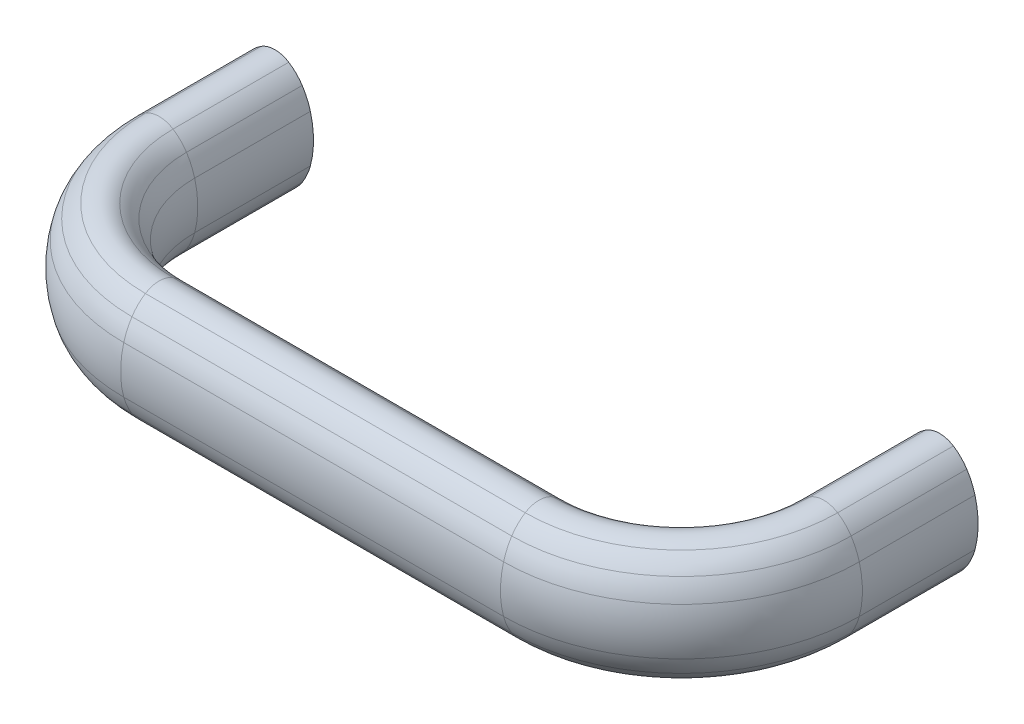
ISO-10303-21;
HEADER;
FILE_DESCRIPTION(('STEP AP214'),'2;1');
FILE_NAME('part.step','',(''),(''),'','','');
FILE_SCHEMA(('AUTOMOTIVE_DESIGN { 1 0 10303 214 1 1 1 1 }'));
ENDSEC;
DATA;
#1=APPLICATION_CONTEXT('core data for automotive mechanical design processes');
#2=APPLICATION_PROTOCOL_DEFINITION('international standard','automotive_design',2000,#1);
#3=PRODUCT_CONTEXT('',#1,'mechanical');
#4=PRODUCT('Part','Part','',(#3));
#5=PRODUCT_RELATED_PRODUCT_CATEGORY('part','',(#4));
#6=PRODUCT_DEFINITION_FORMATION('','',#4);
#7=PRODUCT_DEFINITION_CONTEXT('part definition',#1,'design');
#8=PRODUCT_DEFINITION('design','',#6,#7);
#9=PRODUCT_DEFINITION_SHAPE('','',#8);
#10=(LENGTH_UNIT() NAMED_UNIT(*) SI_UNIT(.MILLI.,.METRE.));
#11=(NAMED_UNIT(*) PLANE_ANGLE_UNIT() SI_UNIT($,.RADIAN.));
#12=(NAMED_UNIT(*) SI_UNIT($,.STERADIAN.) SOLID_ANGLE_UNIT());
#13=UNCERTAINTY_MEASURE_WITH_UNIT(LENGTH_MEASURE(1.E-05),#10,'distance_accuracy_value','');
#14=(GEOMETRIC_REPRESENTATION_CONTEXT(3) GLOBAL_UNCERTAINTY_ASSIGNED_CONTEXT((#13)) GLOBAL_UNIT_ASSIGNED_CONTEXT((#10,
#11,#12)) REPRESENTATION_CONTEXT('',''));
#15=CARTESIAN_POINT('',(0.,0.,0.));
#16=DIRECTION('',(0.,0.,1.));
#17=DIRECTION('',(1.,0.,0.));
#18=AXIS2_PLACEMENT_3D('',#15,#16,#17);
#19=CARTESIAN_POINT('',(110.266980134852,2.95863916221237,19.4999999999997));
#20=DIRECTION('',(0.,0.,-1.));
#21=DIRECTION('',(0.,1.,0.));
#22=AXIS2_PLACEMENT_3D('',#19,#20,#21);
#23=CYLINDRICAL_SURFACE('',#22,7.54594714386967);
#24=CARTESIAN_POINT('',(110.266980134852,2.95863916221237,19.4999999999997));
#25=DIRECTION('',(0.,0.,1.));
#26=DIRECTION('',(0.,1.,0.));
#27=AXIS2_PLACEMENT_3D('',#24,#25,#26);
#28=CIRCLE('',#27,7.54594714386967);
#29=CARTESIAN_POINT('',(116.593831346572,7.07109244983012,19.5));
#30=VERTEX_POINT('',#29);
#31=CARTESIAN_POINT('',(114.322235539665,9.32230335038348,19.5));
#32=VERTEX_POINT('',#31);
#33=EDGE_CURVE('E504',#30,#32,#28,.T.);
#34=ORIENTED_EDGE('',*,*,#33,.F.);
#35=DIRECTION('',(0.,0.,-1.));
#36=VECTOR('',#35,1.);
#37=CARTESIAN_POINT('',(116.593831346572,7.07109244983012,19.5));
#38=LINE('',#37,#36);
#39=CARTESIAN_POINT('',(116.593831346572,7.07109244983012,0.));
#40=VERTEX_POINT('',#39);
#41=EDGE_CURVE('E22',#30,#40,#38,.T.);
#42=ORIENTED_EDGE('',*,*,#41,.T.);
#43=CARTESIAN_POINT('',(110.266980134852,2.95863916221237,0.));
#44=DIRECTION('',(0.,0.,1.));
#45=DIRECTION('',(0.,1.,0.));
#46=AXIS2_PLACEMENT_3D('',#43,#44,#45);
#47=CIRCLE('',#46,7.54594714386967);
#48=CARTESIAN_POINT('',(114.322235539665,9.32230335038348,0.));
#49=VERTEX_POINT('',#48);
#50=EDGE_CURVE('E17',#40,#49,#47,.T.);
#51=ORIENTED_EDGE('',*,*,#50,.T.);
#52=DIRECTION('',(0.,0.,-1.));
#53=VECTOR('',#52,1.);
#54=CARTESIAN_POINT('',(114.322235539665,9.32230335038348,19.5));
#55=LINE('',#54,#53);
#56=EDGE_CURVE('E9',#32,#49,#55,.T.);
#57=ORIENTED_EDGE('',*,*,#56,.F.);
#58=EDGE_LOOP('',(#34,#42,#51,#57));
#59=FACE_BOUND('',#58,.T.);
#60=ADVANCED_FACE('F14',(#59),#23,.T.);
#61=CARTESIAN_POINT('',(107.517667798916,1.17158614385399,19.4999999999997));
#62=DIRECTION('',(0.,0.,-1.));
#63=DIRECTION('',(0.,1.,0.));
#64=AXIS2_PLACEMENT_3D('',#61,#62,#63);
#65=CYLINDRICAL_SURFACE('',#64,10.8250135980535);
#66=CARTESIAN_POINT('',(107.517667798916,1.17158614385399,19.4999999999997));
#67=DIRECTION('',(0.,0.,1.));
#68=DIRECTION('',(0.,1.,0.));
#69=AXIS2_PLACEMENT_3D('',#66,#67,#68);
#70=CIRCLE('',#69,10.8250135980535);
#71=CARTESIAN_POINT('',(117.97045040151,3.98588095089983,19.5));
#72=VERTEX_POINT('',#71);
#73=EDGE_CURVE('E564',#72,#30,#70,.T.);
#74=ORIENTED_EDGE('',*,*,#73,.F.);
#75=DIRECTION('',(0.,0.,-1.));
#76=VECTOR('',#75,1.);
#77=CARTESIAN_POINT('',(117.97045040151,3.98588095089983,19.5));
#78=LINE('',#77,#76);
#79=CARTESIAN_POINT('',(117.97045040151,3.98588095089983,0.));
#80=VERTEX_POINT('',#79);
#81=EDGE_CURVE('E596',#72,#80,#78,.T.);
#82=ORIENTED_EDGE('',*,*,#81,.T.);
#83=CARTESIAN_POINT('',(107.517667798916,1.17158614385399,0.));
#84=DIRECTION('',(0.,0.,1.));
#85=DIRECTION('',(0.,1.,0.));
#86=AXIS2_PLACEMENT_3D('',#83,#84,#85);
#87=CIRCLE('',#86,10.8250135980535);
#88=EDGE_CURVE('E38',#80,#40,#87,.T.);
#89=ORIENTED_EDGE('',*,*,#88,.T.);
#90=ORIENTED_EDGE('',*,*,#41,.F.);
#91=EDGE_LOOP('',(#74,#82,#89,#90));
#92=FACE_BOUND('',#91,.T.);
#93=ADVANCED_FACE('F685',(#92),#65,.T.);
#94=CARTESIAN_POINT('',(103.166283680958,2.46379646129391E-05,19.4999999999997));
#95=DIRECTION('',(0.,0.,-1.));
#96=DIRECTION('',(0.,1.,0.));
#97=AXIS2_PLACEMENT_3D('',#94,#95,#96);
#98=CYLINDRICAL_SURFACE('',#97,15.331353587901);
#99=CARTESIAN_POINT('',(103.166283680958,2.46379646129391E-05,19.4999999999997));
#100=DIRECTION('',(0.,0.,1.));
#101=DIRECTION('',(0.,1.,0.));
#102=AXIS2_PLACEMENT_3D('',#99,#100,#101);
#103=CIRCLE('',#102,15.331353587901);
#104=CARTESIAN_POINT('',(117.97045040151,-3.98583167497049,19.5));
#105=VERTEX_POINT('',#104);
#106=EDGE_CURVE('E562',#105,#72,#103,.T.);
#107=ORIENTED_EDGE('',*,*,#106,.F.);
#108=DIRECTION('',(0.,0.,-1.));
#109=VECTOR('',#108,1.);
#110=CARTESIAN_POINT('',(117.97045040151,-3.98583167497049,19.5));
#111=LINE('',#110,#109);
#112=CARTESIAN_POINT('',(117.97045040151,-3.98583167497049,0.));
#113=VERTEX_POINT('',#112);
#114=EDGE_CURVE('E593',#105,#113,#111,.T.);
#115=ORIENTED_EDGE('',*,*,#114,.T.);
#116=CARTESIAN_POINT('',(103.166283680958,2.46379646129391E-05,0.));
#117=DIRECTION('',(0.,0.,1.));
#118=DIRECTION('',(0.,1.,0.));
#119=AXIS2_PLACEMENT_3D('',#116,#117,#118);
#120=CIRCLE('',#119,15.331353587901);
#121=EDGE_CURVE('E622',#113,#80,#120,.T.);
#122=ORIENTED_EDGE('',*,*,#121,.T.);
#123=ORIENTED_EDGE('',*,*,#81,.F.);
#124=EDGE_LOOP('',(#107,#115,#122,#123));
#125=FACE_BOUND('',#124,.T.);
#126=ADVANCED_FACE('F690',(#125),#98,.T.);
#127=CARTESIAN_POINT('',(107.517667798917,-1.1715368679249,19.4999999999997));
#128=DIRECTION('',(0.,0.,-1.));
#129=DIRECTION('',(0.,1.,0.));
#130=AXIS2_PLACEMENT_3D('',#127,#128,#129);
#131=CYLINDRICAL_SURFACE('',#130,10.8250135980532);
#132=CARTESIAN_POINT('',(107.517667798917,-1.1715368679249,19.4999999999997));
#133=DIRECTION('',(0.,0.,1.));
#134=DIRECTION('',(0.,1.,0.));
#135=AXIS2_PLACEMENT_3D('',#132,#133,#134);
#136=CIRCLE('',#135,10.8250135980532);
#137=CARTESIAN_POINT('',(116.593831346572,-7.07104317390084,19.5));
#138=VERTEX_POINT('',#137);
#139=EDGE_CURVE('E559',#138,#105,#136,.T.);
#140=ORIENTED_EDGE('',*,*,#139,.F.);
#141=DIRECTION('',(0.,0.,-1.));
#142=VECTOR('',#141,1.);
#143=CARTESIAN_POINT('',(116.593831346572,-7.07104317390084,19.5));
#144=LINE('',#143,#142);
#145=CARTESIAN_POINT('',(116.593831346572,-7.07104317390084,0.));
#146=VERTEX_POINT('',#145);
#147=EDGE_CURVE('E590',#138,#146,#144,.T.);
#148=ORIENTED_EDGE('',*,*,#147,.T.);
#149=CARTESIAN_POINT('',(107.517667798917,-1.1715368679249,0.));
#150=DIRECTION('',(0.,0.,1.));
#151=DIRECTION('',(0.,1.,0.));
#152=AXIS2_PLACEMENT_3D('',#149,#150,#151);
#153=CIRCLE('',#152,10.8250135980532);
#154=EDGE_CURVE('E620',#146,#113,#153,.T.);
#155=ORIENTED_EDGE('',*,*,#154,.T.);
#156=ORIENTED_EDGE('',*,*,#114,.F.);
#157=EDGE_LOOP('',(#140,#148,#155,#156));
#158=FACE_BOUND('',#157,.T.);
#159=ADVANCED_FACE('F695',(#158),#131,.T.);
#160=CARTESIAN_POINT('',(110.266980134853,-2.95858988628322,19.4999999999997));
#161=DIRECTION('',(0.,0.,-1.));
#162=DIRECTION('',(0.,1.,0.));
#163=AXIS2_PLACEMENT_3D('',#160,#161,#162);
#164=CYLINDRICAL_SURFACE('',#163,7.54594714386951);
#165=CARTESIAN_POINT('',(110.266980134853,-2.95858988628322,19.4999999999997));
#166=DIRECTION('',(0.,0.,1.));
#167=DIRECTION('',(0.,1.,0.));
#168=AXIS2_PLACEMENT_3D('',#165,#166,#167);
#169=CIRCLE('',#168,7.54594714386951);
#170=CARTESIAN_POINT('',(114.322235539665,-9.32225407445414,19.5));
#171=VERTEX_POINT('',#170);
#172=EDGE_CURVE('E556',#171,#138,#169,.T.);
#173=ORIENTED_EDGE('',*,*,#172,.F.);
#174=DIRECTION('',(0.,0.,-1.));
#175=VECTOR('',#174,1.);
#176=CARTESIAN_POINT('',(114.322235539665,-9.32225407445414,19.5));
#177=LINE('',#176,#175);
#178=CARTESIAN_POINT('',(114.322235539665,-9.32225407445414,0.));
#179=VERTEX_POINT('',#178);
#180=EDGE_CURVE('E587',#171,#179,#177,.T.);
#181=ORIENTED_EDGE('',*,*,#180,.T.);
#182=CARTESIAN_POINT('',(110.266980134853,-2.95858988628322,0.));
#183=DIRECTION('',(0.,0.,1.));
#184=DIRECTION('',(0.,1.,0.));
#185=AXIS2_PLACEMENT_3D('',#182,#183,#184);
#186=CIRCLE('',#185,7.54594714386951);
#187=EDGE_CURVE('E618',#179,#146,#186,.T.);
#188=ORIENTED_EDGE('',*,*,#187,.T.);
#189=ORIENTED_EDGE('',*,*,#147,.F.);
#190=EDGE_LOOP('',(#173,#181,#188,#189));
#191=FACE_BOUND('',#190,.T.);
#192=ADVANCED_FACE('F701',(#191),#164,.T.);
#193=CARTESIAN_POINT('',(111.997637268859,-5.67440423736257,19.4999999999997));
#194=DIRECTION('',(0.,0.,-1.));
#195=DIRECTION('',(0.,1.,0.));
#196=AXIS2_PLACEMENT_3D('',#193,#194,#195);
#197=CYLINDRICAL_SURFACE('',#196,4.3255711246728);
#198=CARTESIAN_POINT('',(111.997637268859,-5.67440423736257,19.4999999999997));
#199=DIRECTION('',(0.,0.,-1.));
#200=DIRECTION('',(0.,-1.,0.));
#201=AXIS2_PLACEMENT_3D('',#198,#199,#200);
#202=CIRCLE('',#201,4.3255711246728);
#203=CARTESIAN_POINT('',(109.673038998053,-9.32225407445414,19.4999999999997));
#204=VERTEX_POINT('',#203);
#205=EDGE_CURVE('E553',#171,#204,#202,.T.);
#206=ORIENTED_EDGE('',*,*,#205,.T.);
#207=DIRECTION('',(0.,0.,-1.));
#208=VECTOR('',#207,1.);
#209=CARTESIAN_POINT('',(109.673038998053,-9.32225407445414,19.4999999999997));
#210=LINE('',#209,#208);
#211=CARTESIAN_POINT('',(109.673038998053,-9.32225407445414,0.));
#212=VERTEX_POINT('',#211);
#213=EDGE_CURVE('E584',#204,#212,#210,.T.);
#214=ORIENTED_EDGE('',*,*,#213,.T.);
#215=CARTESIAN_POINT('',(111.997637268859,-5.67440423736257,0.));
#216=DIRECTION('',(0.,0.,-1.));
#217=DIRECTION('',(0.,-1.,0.));
#218=AXIS2_PLACEMENT_3D('',#215,#216,#217);
#219=CIRCLE('',#218,4.3255711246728);
#220=EDGE_CURVE('E615',#179,#212,#219,.T.);
#221=ORIENTED_EDGE('',*,*,#220,.F.);
#222=ORIENTED_EDGE('',*,*,#180,.F.);
#223=EDGE_LOOP('',(#206,#214,#221,#222));
#224=FACE_BOUND('',#223,.T.);
#225=ADVANCED_FACE('F705',(#224),#197,.T.);
#226=CARTESIAN_POINT('',(113.728294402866,-2.95858988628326,19.5));
#227=DIRECTION('',(0.,0.,-1.));
#228=DIRECTION('',(0.,1.,0.));
#229=AXIS2_PLACEMENT_3D('',#226,#227,#228);
#230=CYLINDRICAL_SURFACE('',#229,7.54594714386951);
#231=CARTESIAN_POINT('',(113.728294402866,-2.95858988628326,19.5));
#232=DIRECTION('',(0.,0.,-1.));
#233=DIRECTION('',(0.,-1.,0.));
#234=AXIS2_PLACEMENT_3D('',#231,#232,#233);
#235=CIRCLE('',#234,7.54594714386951);
#236=CARTESIAN_POINT('',(107.401443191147,-7.07104317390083,19.4999999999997));
#237=VERTEX_POINT('',#236);
#238=EDGE_CURVE('E550',#204,#237,#235,.T.);
#239=ORIENTED_EDGE('',*,*,#238,.T.);
#240=DIRECTION('',(0.,0.,-1.));
#241=VECTOR('',#240,1.);
#242=CARTESIAN_POINT('',(107.401443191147,-7.07104317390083,19.4999999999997));
#243=LINE('',#242,#241);
#244=CARTESIAN_POINT('',(107.401443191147,-7.07104317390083,0.));
#245=VERTEX_POINT('',#244);
#246=EDGE_CURVE('E581',#237,#245,#243,.T.);
#247=ORIENTED_EDGE('',*,*,#246,.T.);
#248=CARTESIAN_POINT('',(113.728294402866,-2.95858988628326,0.));
#249=DIRECTION('',(0.,0.,-1.));
#250=DIRECTION('',(0.,-1.,0.));
#251=AXIS2_PLACEMENT_3D('',#248,#249,#250);
#252=CIRCLE('',#251,7.54594714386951);
#253=EDGE_CURVE('E612',#212,#245,#252,.T.);
#254=ORIENTED_EDGE('',*,*,#253,.F.);
#255=ORIENTED_EDGE('',*,*,#213,.F.);
#256=EDGE_LOOP('',(#239,#247,#254,#255));
#257=FACE_BOUND('',#256,.T.);
#258=ADVANCED_FACE('F709',(#257),#230,.T.);
#259=CARTESIAN_POINT('',(116.477606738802,-1.17153686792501,19.5));
#260=DIRECTION('',(0.,0.,-1.));
#261=DIRECTION('',(0.,1.,0.));
#262=AXIS2_PLACEMENT_3D('',#259,#260,#261);
#263=CYLINDRICAL_SURFACE('',#262,10.8250135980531);
#264=CARTESIAN_POINT('',(116.477606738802,-1.17153686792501,19.5));
#265=DIRECTION('',(0.,0.,-1.));
#266=DIRECTION('',(0.,-1.,0.));
#267=AXIS2_PLACEMENT_3D('',#264,#265,#266);
#268=CIRCLE('',#267,10.8250135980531);
#269=CARTESIAN_POINT('',(106.024824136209,-3.98583167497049,19.4999999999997));
#270=VERTEX_POINT('',#269);
#271=EDGE_CURVE('E547',#237,#270,#268,.T.);
#272=ORIENTED_EDGE('',*,*,#271,.T.);
#273=DIRECTION('',(0.,0.,-1.));
#274=VECTOR('',#273,1.);
#275=CARTESIAN_POINT('',(106.024824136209,-3.98583167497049,19.4999999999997));
#276=LINE('',#275,#274);
#277=CARTESIAN_POINT('',(106.024824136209,-3.98583167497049,0.));
#278=VERTEX_POINT('',#277);
#279=EDGE_CURVE('E578',#270,#278,#276,.T.);
#280=ORIENTED_EDGE('',*,*,#279,.T.);
#281=CARTESIAN_POINT('',(116.477606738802,-1.17153686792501,0.));
#282=DIRECTION('',(0.,0.,-1.));
#283=DIRECTION('',(0.,-1.,0.));
#284=AXIS2_PLACEMENT_3D('',#281,#282,#283);
#285=CIRCLE('',#284,10.8250135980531);
#286=EDGE_CURVE('E609',#245,#278,#285,.T.);
#287=ORIENTED_EDGE('',*,*,#286,.F.);
#288=ORIENTED_EDGE('',*,*,#246,.F.);
#289=EDGE_LOOP('',(#272,#280,#287,#288));
#290=FACE_BOUND('',#289,.T.);
#291=ADVANCED_FACE('F713',(#290),#263,.T.);
#292=CARTESIAN_POINT('',(120.82899085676,2.46379646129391E-05,19.5));
#293=DIRECTION('',(0.,0.,-1.));
#294=DIRECTION('',(0.,1.,0.));
#295=AXIS2_PLACEMENT_3D('',#292,#293,#294);
#296=CYLINDRICAL_SURFACE('',#295,15.331353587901);
#297=CARTESIAN_POINT('',(120.82899085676,2.46379646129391E-05,19.5));
#298=DIRECTION('',(0.,0.,-1.));
#299=DIRECTION('',(0.,-1.,0.));
#300=AXIS2_PLACEMENT_3D('',#297,#298,#299);
#301=CIRCLE('',#300,15.331353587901);
#302=CARTESIAN_POINT('',(106.024824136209,3.98588095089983,19.4999999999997));
#303=VERTEX_POINT('',#302);
#304=EDGE_CURVE('E544',#270,#303,#301,.T.);
#305=ORIENTED_EDGE('',*,*,#304,.T.);
#306=DIRECTION('',(0.,0.,-1.));
#307=VECTOR('',#306,1.);
#308=CARTESIAN_POINT('',(106.024824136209,3.98588095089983,19.4999999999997));
#309=LINE('',#308,#307);
#310=CARTESIAN_POINT('',(106.024824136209,3.98588095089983,0.));
#311=VERTEX_POINT('',#310);
#312=EDGE_CURVE('E575',#303,#311,#309,.T.);
#313=ORIENTED_EDGE('',*,*,#312,.T.);
#314=CARTESIAN_POINT('',(120.82899085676,2.46379646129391E-05,0.));
#315=DIRECTION('',(0.,0.,-1.));
#316=DIRECTION('',(0.,-1.,0.));
#317=AXIS2_PLACEMENT_3D('',#314,#315,#316);
#318=CIRCLE('',#317,15.331353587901);
#319=EDGE_CURVE('E606',#278,#311,#318,.T.);
#320=ORIENTED_EDGE('',*,*,#319,.F.);
#321=ORIENTED_EDGE('',*,*,#279,.F.);
#322=EDGE_LOOP('',(#305,#313,#320,#321));
#323=FACE_BOUND('',#322,.T.);
#324=ADVANCED_FACE('F717',(#323),#296,.T.);
#325=CARTESIAN_POINT('',(116.477606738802,1.1715861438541,19.5));
#326=DIRECTION('',(0.,0.,-1.));
#327=DIRECTION('',(0.,1.,0.));
#328=AXIS2_PLACEMENT_3D('',#325,#326,#327);
#329=CYLINDRICAL_SURFACE('',#328,10.8250135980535);
#330=CARTESIAN_POINT('',(116.477606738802,1.1715861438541,19.5));
#331=DIRECTION('',(0.,0.,-1.));
#332=DIRECTION('',(0.,-1.,0.));
#333=AXIS2_PLACEMENT_3D('',#330,#331,#332);
#334=CIRCLE('',#333,10.8250135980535);
#335=CARTESIAN_POINT('',(107.401443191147,7.07109244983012,19.4999999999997));
#336=VERTEX_POINT('',#335);
#337=EDGE_CURVE('E541',#303,#336,#334,.T.);
#338=ORIENTED_EDGE('',*,*,#337,.T.);
#339=DIRECTION('',(0.,0.,-1.));
#340=VECTOR('',#339,1.);
#341=CARTESIAN_POINT('',(107.401443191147,7.07109244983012,19.4999999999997));
#342=LINE('',#341,#340);
#343=CARTESIAN_POINT('',(107.401443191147,7.07109244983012,0.));
#344=VERTEX_POINT('',#343);
#345=EDGE_CURVE('E572',#336,#344,#342,.T.);
#346=ORIENTED_EDGE('',*,*,#345,.T.);
#347=CARTESIAN_POINT('',(116.477606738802,1.1715861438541,0.));
#348=DIRECTION('',(0.,0.,-1.));
#349=DIRECTION('',(0.,-1.,0.));
#350=AXIS2_PLACEMENT_3D('',#347,#348,#349);
#351=CIRCLE('',#350,10.8250135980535);
#352=EDGE_CURVE('E603',#311,#344,#351,.T.);
#353=ORIENTED_EDGE('',*,*,#352,.F.);
#354=ORIENTED_EDGE('',*,*,#312,.F.);
#355=EDGE_LOOP('',(#338,#346,#353,#354));
#356=FACE_BOUND('',#355,.T.);
#357=ADVANCED_FACE('F721',(#356),#329,.T.);
#358=CARTESIAN_POINT('',(113.728294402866,2.95863916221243,19.5));
#359=DIRECTION('',(0.,0.,-1.));
#360=DIRECTION('',(0.,1.,0.));
#361=AXIS2_PLACEMENT_3D('',#358,#359,#360);
#362=CYLINDRICAL_SURFACE('',#361,7.54594714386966);
#363=CARTESIAN_POINT('',(113.728294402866,2.95863916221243,19.5));
#364=DIRECTION('',(0.,0.,-1.));
#365=DIRECTION('',(0.,-1.,0.));
#366=AXIS2_PLACEMENT_3D('',#363,#364,#365);
#367=CIRCLE('',#366,7.54594714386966);
#368=CARTESIAN_POINT('',(109.673038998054,9.32230335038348,19.4999999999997));
#369=VERTEX_POINT('',#368);
#370=EDGE_CURVE('E538',#336,#369,#367,.T.);
#371=ORIENTED_EDGE('',*,*,#370,.T.);
#372=DIRECTION('',(0.,0.,-1.));
#373=VECTOR('',#372,1.);
#374=CARTESIAN_POINT('',(109.673038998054,9.32230335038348,19.4999999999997));
#375=LINE('',#374,#373);
#376=CARTESIAN_POINT('',(109.673038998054,9.32230335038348,0.));
#377=VERTEX_POINT('',#376);
#378=EDGE_CURVE('E569',#369,#377,#375,.T.);
#379=ORIENTED_EDGE('',*,*,#378,.T.);
#380=CARTESIAN_POINT('',(113.728294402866,2.95863916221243,0.));
#381=DIRECTION('',(0.,0.,-1.));
#382=DIRECTION('',(0.,-1.,0.));
#383=AXIS2_PLACEMENT_3D('',#380,#381,#382);
#384=CIRCLE('',#383,7.54594714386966);
#385=EDGE_CURVE('E601',#344,#377,#384,.T.);
#386=ORIENTED_EDGE('',*,*,#385,.F.);
#387=ORIENTED_EDGE('',*,*,#345,.F.);
#388=EDGE_LOOP('',(#371,#379,#386,#387));
#389=FACE_BOUND('',#388,.T.);
#390=ADVANCED_FACE('F682',(#389),#362,.T.);
#391=CARTESIAN_POINT('',(111.997637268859,5.67445351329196,19.4999999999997));
#392=DIRECTION('',(0.,0.,-1.));
#393=DIRECTION('',(0.,1.,0.));
#394=AXIS2_PLACEMENT_3D('',#391,#392,#393);
#395=CYLINDRICAL_SURFACE('',#394,4.32557112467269);
#396=CARTESIAN_POINT('',(111.997637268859,5.67445351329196,19.4999999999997));
#397=DIRECTION('',(0.,0.,-1.));
#398=DIRECTION('',(0.,-1.,0.));
#399=AXIS2_PLACEMENT_3D('',#396,#397,#398);
#400=CIRCLE('',#399,4.32557112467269);
#401=EDGE_CURVE('E467',#369,#32,#400,.T.);
#402=ORIENTED_EDGE('',*,*,#401,.T.);
#403=ORIENTED_EDGE('',*,*,#56,.T.);
#404=CARTESIAN_POINT('',(111.997637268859,5.67445351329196,0.));
#405=DIRECTION('',(0.,0.,-1.));
#406=DIRECTION('',(0.,-1.,0.));
#407=AXIS2_PLACEMENT_3D('',#404,#405,#406);
#408=CIRCLE('',#407,4.32557112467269);
#409=EDGE_CURVE('E30',#377,#49,#408,.T.);
#410=ORIENTED_EDGE('',*,*,#409,.F.);
#411=ORIENTED_EDGE('',*,*,#378,.F.);
#412=EDGE_LOOP('',(#402,#403,#410,#411));
#413=FACE_BOUND('',#412,.T.);
#414=ADVANCED_FACE('F627',(#413),#395,.T.);
#415=CARTESIAN_POINT('',(88.,2.95863916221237,19.5));
#416=DIRECTION('',(0.,1.,0.));
#417=DIRECTION('',(-1.,0.,0.));
#418=AXIS2_PLACEMENT_3D('',#415,#416,#417);
#419=TOROIDAL_SURFACE('',#418,22.2669801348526,7.54594714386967);
#420=CARTESIAN_POINT('',(88.,2.95863916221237,41.7669801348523));
#421=DIRECTION('',(-1.,0.,0.));
#422=DIRECTION('',(0.,1.,0.));
#423=AXIS2_PLACEMENT_3D('',#420,#421,#422);
#424=CIRCLE('',#423,7.54594714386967);
#425=CARTESIAN_POINT('',(88.,7.07109244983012,48.0938313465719));
#426=VERTEX_POINT('',#425);
#427=CARTESIAN_POINT('',(88.,9.32230335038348,45.8222355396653));
#428=VERTEX_POINT('',#427);
#429=EDGE_CURVE('E434',#426,#428,#424,.T.);
#430=ORIENTED_EDGE('',*,*,#429,.F.);
#431=CARTESIAN_POINT('',(88.,7.07109244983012,19.5));
#432=DIRECTION('',(0.,1.,0.));
#433=DIRECTION('',(-1.,0.,0.));
#434=AXIS2_PLACEMENT_3D('',#431,#432,#433);
#435=CIRCLE('',#434,28.5938313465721);
#436=EDGE_CURVE('E531',#426,#30,#435,.T.);
#437=ORIENTED_EDGE('',*,*,#436,.T.);
#438=ORIENTED_EDGE('',*,*,#33,.T.);
#439=CARTESIAN_POINT('',(88.,9.32230335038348,19.5));
#440=DIRECTION('',(0.,1.,0.));
#441=DIRECTION('',(-1.,0.,0.));
#442=AXIS2_PLACEMENT_3D('',#439,#440,#441);
#443=CIRCLE('',#442,26.3222355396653);
#444=EDGE_CURVE('E534',#428,#32,#443,.T.);
#445=ORIENTED_EDGE('',*,*,#444,.F.);
#446=EDGE_LOOP('',(#430,#437,#438,#445));
#447=FACE_BOUND('',#446,.T.);
#448=ADVANCED_FACE('F671',(#447),#419,.T.);
#449=CARTESIAN_POINT('',(88.,1.17158614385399,19.5));
#450=DIRECTION('',(0.,1.,0.));
#451=DIRECTION('',(-1.,0.,0.));
#452=AXIS2_PLACEMENT_3D('',#449,#450,#451);
#453=TOROIDAL_SURFACE('',#452,19.5176677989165,10.8250135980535);
#454=CARTESIAN_POINT('',(88.,1.17158614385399,39.0176677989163));
#455=DIRECTION('',(-1.,0.,0.));
#456=DIRECTION('',(0.,1.,0.));
#457=AXIS2_PLACEMENT_3D('',#454,#455,#456);
#458=CIRCLE('',#457,10.8250135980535);
#459=CARTESIAN_POINT('',(88.,3.98588095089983,49.4704504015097));
#460=VERTEX_POINT('',#459);
#461=EDGE_CURVE('E495',#460,#426,#458,.T.);
#462=ORIENTED_EDGE('',*,*,#461,.F.);
#463=CARTESIAN_POINT('',(88.,3.98588095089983,19.5));
#464=DIRECTION('',(0.,1.,0.));
#465=DIRECTION('',(-1.,0.,0.));
#466=AXIS2_PLACEMENT_3D('',#463,#464,#465);
#467=CIRCLE('',#466,29.9704504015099);
#468=EDGE_CURVE('E528',#460,#72,#467,.T.);
#469=ORIENTED_EDGE('',*,*,#468,.T.);
#470=ORIENTED_EDGE('',*,*,#73,.T.);
#471=ORIENTED_EDGE('',*,*,#436,.F.);
#472=EDGE_LOOP('',(#462,#469,#470,#471));
#473=FACE_BOUND('',#472,.T.);
#474=ADVANCED_FACE('F666',(#473),#453,.T.);
#475=CARTESIAN_POINT('',(88.,2.46379646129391E-05,19.5));
#476=DIRECTION('',(0.,1.,0.));
#477=DIRECTION('',(-1.,0.,0.));
#478=AXIS2_PLACEMENT_3D('',#475,#476,#477);
#479=DEGENERATE_TOROIDAL_SURFACE('',#478,15.1662836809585,15.331353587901,.T.);
#480=CARTESIAN_POINT('',(88.,2.46379646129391E-05,34.6662836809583));
#481=DIRECTION('',(-1.,0.,0.));
#482=DIRECTION('',(0.,1.,0.));
#483=AXIS2_PLACEMENT_3D('',#480,#481,#482);
#484=CIRCLE('',#483,15.331353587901);
#485=CARTESIAN_POINT('',(88.,-3.98583167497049,49.4704504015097));
#486=VERTEX_POINT('',#485);
#487=EDGE_CURVE('E493',#486,#460,#484,.T.);
#488=ORIENTED_EDGE('',*,*,#487,.F.);
#489=CARTESIAN_POINT('',(88.,-3.98583167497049,19.5));
#490=DIRECTION('',(0.,1.,0.));
#491=DIRECTION('',(-1.,0.,0.));
#492=AXIS2_PLACEMENT_3D('',#489,#490,#491);
#493=CIRCLE('',#492,29.9704504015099);
#494=EDGE_CURVE('E525',#486,#105,#493,.T.);
#495=ORIENTED_EDGE('',*,*,#494,.T.);
#496=ORIENTED_EDGE('',*,*,#106,.T.);
#497=ORIENTED_EDGE('',*,*,#468,.F.);
#498=EDGE_LOOP('',(#488,#495,#496,#497));
#499=FACE_BOUND('',#498,.T.);
#500=ADVANCED_FACE('F680',(#499),#479,.T.);
#501=CARTESIAN_POINT('',(88.,-1.1715368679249,19.5));
#502=DIRECTION('',(0.,1.,0.));
#503=DIRECTION('',(-1.,0.,0.));
#504=AXIS2_PLACEMENT_3D('',#501,#502,#503);
#505=TOROIDAL_SURFACE('',#504,19.5176677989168,10.8250135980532);
#506=CARTESIAN_POINT('',(88.,-1.1715368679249,39.0176677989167));
#507=DIRECTION('',(-1.,0.,0.));
#508=DIRECTION('',(0.,1.,0.));
#509=AXIS2_PLACEMENT_3D('',#506,#507,#508);
#510=CIRCLE('',#509,10.8250135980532);
#511=CARTESIAN_POINT('',(88.,-7.07104317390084,48.0938313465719));
#512=VERTEX_POINT('',#511);
#513=EDGE_CURVE('E490',#512,#486,#510,.T.);
#514=ORIENTED_EDGE('',*,*,#513,.F.);
#515=CARTESIAN_POINT('',(88.,-7.07104317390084,19.5));
#516=DIRECTION('',(0.,1.,0.));
#517=DIRECTION('',(-1.,0.,0.));
#518=AXIS2_PLACEMENT_3D('',#515,#516,#517);
#519=CIRCLE('',#518,28.5938313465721);
#520=EDGE_CURVE('E522',#512,#138,#519,.T.);
#521=ORIENTED_EDGE('',*,*,#520,.T.);
#522=ORIENTED_EDGE('',*,*,#139,.T.);
#523=ORIENTED_EDGE('',*,*,#494,.F.);
#524=EDGE_LOOP('',(#514,#521,#522,#523));
#525=FACE_BOUND('',#524,.T.);
#526=ADVANCED_FACE('F898',(#525),#505,.T.);
#527=CARTESIAN_POINT('',(88.,-2.95858988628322,19.5));
#528=DIRECTION('',(0.,1.,0.));
#529=DIRECTION('',(-1.,0.,0.));
#530=AXIS2_PLACEMENT_3D('',#527,#528,#529);
#531=TOROIDAL_SURFACE('',#530,22.2669801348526,7.54594714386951);
#532=CARTESIAN_POINT('',(88.,-2.95858988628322,41.7669801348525));
#533=DIRECTION('',(-1.,0.,0.));
#534=DIRECTION('',(0.,1.,0.));
#535=AXIS2_PLACEMENT_3D('',#532,#533,#534);
#536=CIRCLE('',#535,7.54594714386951);
#537=CARTESIAN_POINT('',(88.,-9.32225407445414,45.8222355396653));
#538=VERTEX_POINT('',#537);
#539=EDGE_CURVE('E487',#538,#512,#536,.T.);
#540=ORIENTED_EDGE('',*,*,#539,.F.);
#541=CARTESIAN_POINT('',(88.,-9.32225407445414,19.5));
#542=DIRECTION('',(0.,1.,0.));
#543=DIRECTION('',(-1.,0.,0.));
#544=AXIS2_PLACEMENT_3D('',#541,#542,#543);
#545=CIRCLE('',#544,26.3222355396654);
#546=EDGE_CURVE('E519',#538,#171,#545,.T.);
#547=ORIENTED_EDGE('',*,*,#546,.T.);
#548=ORIENTED_EDGE('',*,*,#172,.T.);
#549=ORIENTED_EDGE('',*,*,#520,.F.);
#550=EDGE_LOOP('',(#540,#547,#548,#549));
#551=FACE_BOUND('',#550,.T.);
#552=ADVANCED_FACE('F894',(#551),#531,.T.);
#553=CARTESIAN_POINT('',(88.,-5.67440423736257,19.5));
#554=DIRECTION('',(0.,1.,0.));
#555=DIRECTION('',(-1.,0.,0.));
#556=AXIS2_PLACEMENT_3D('',#553,#554,#555);
#557=TOROIDAL_SURFACE('',#556,23.9976372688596,4.3255711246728);
#558=CARTESIAN_POINT('',(88.,-5.67440423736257,43.4976372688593));
#559=DIRECTION('',(1.,0.,0.));
#560=DIRECTION('',(0.,-1.,0.));
#561=AXIS2_PLACEMENT_3D('',#558,#559,#560);
#562=CIRCLE('',#561,4.3255711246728);
#563=CARTESIAN_POINT('',(88.,-9.32225407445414,41.1730389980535));
#564=VERTEX_POINT('',#563);
#565=EDGE_CURVE('E484',#538,#564,#562,.T.);
#566=ORIENTED_EDGE('',*,*,#565,.T.);
#567=CARTESIAN_POINT('',(88.,-9.32225407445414,19.5));
#568=DIRECTION('',(0.,1.,0.));
#569=DIRECTION('',(-1.,0.,0.));
#570=AXIS2_PLACEMENT_3D('',#567,#568,#569);
#571=CIRCLE('',#570,21.6730389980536);
#572=EDGE_CURVE('E516',#564,#204,#571,.T.);
#573=ORIENTED_EDGE('',*,*,#572,.T.);
#574=ORIENTED_EDGE('',*,*,#205,.F.);
#575=ORIENTED_EDGE('',*,*,#546,.F.);
#576=EDGE_LOOP('',(#566,#573,#574,#575));
#577=FACE_BOUND('',#576,.T.);
#578=ADVANCED_FACE('F890',(#577),#557,.T.);
#579=CARTESIAN_POINT('',(88.,-2.95858988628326,19.5));
#580=DIRECTION('',(0.,1.,0.));
#581=DIRECTION('',(-1.,0.,0.));
#582=AXIS2_PLACEMENT_3D('',#579,#580,#581);
#583=TOROIDAL_SURFACE('',#582,25.7282944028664,7.54594714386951);
#584=CARTESIAN_POINT('',(88.,-2.95858988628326,45.2282944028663));
#585=DIRECTION('',(1.,0.,0.));
#586=DIRECTION('',(0.,-1.,0.));
#587=AXIS2_PLACEMENT_3D('',#584,#585,#586);
#588=CIRCLE('',#587,7.54594714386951);
#589=CARTESIAN_POINT('',(88.,-7.07104317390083,38.9014431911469));
#590=VERTEX_POINT('',#589);
#591=EDGE_CURVE('E481',#564,#590,#588,.T.);
#592=ORIENTED_EDGE('',*,*,#591,.T.);
#593=CARTESIAN_POINT('',(88.,-7.07104317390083,19.5));
#594=DIRECTION('',(0.,1.,0.));
#595=DIRECTION('',(-1.,0.,0.));
#596=AXIS2_PLACEMENT_3D('',#593,#594,#595);
#597=CIRCLE('',#596,19.4014431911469);
#598=EDGE_CURVE('E513',#590,#237,#597,.T.);
#599=ORIENTED_EDGE('',*,*,#598,.T.);
#600=ORIENTED_EDGE('',*,*,#238,.F.);
#601=ORIENTED_EDGE('',*,*,#572,.F.);
#602=EDGE_LOOP('',(#592,#599,#600,#601));
#603=FACE_BOUND('',#602,.T.);
#604=ADVANCED_FACE('F886',(#603),#583,.T.);
#605=CARTESIAN_POINT('',(88.,-1.17153686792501,19.5));
#606=DIRECTION('',(0.,1.,0.));
#607=DIRECTION('',(-1.,0.,0.));
#608=AXIS2_PLACEMENT_3D('',#605,#606,#607);
#609=TOROIDAL_SURFACE('',#608,28.4776067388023,10.8250135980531);
#610=CARTESIAN_POINT('',(88.,-1.17153686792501,47.9776067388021));
#611=DIRECTION('',(1.,0.,0.));
#612=DIRECTION('',(0.,-1.,0.));
#613=AXIS2_PLACEMENT_3D('',#610,#611,#612);
#614=CIRCLE('',#613,10.8250135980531);
#615=CARTESIAN_POINT('',(88.,-3.98583167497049,37.5248241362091));
#616=VERTEX_POINT('',#615);
#617=EDGE_CURVE('E478',#590,#616,#614,.T.);
#618=ORIENTED_EDGE('',*,*,#617,.T.);
#619=CARTESIAN_POINT('',(88.,-3.98583167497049,19.5));
#620=DIRECTION('',(0.,1.,0.));
#621=DIRECTION('',(-1.,0.,0.));
#622=AXIS2_PLACEMENT_3D('',#619,#620,#621);
#623=CIRCLE('',#622,18.0248241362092);
#624=EDGE_CURVE('E510',#616,#270,#623,.T.);
#625=ORIENTED_EDGE('',*,*,#624,.T.);
#626=ORIENTED_EDGE('',*,*,#271,.F.);
#627=ORIENTED_EDGE('',*,*,#598,.F.);
#628=EDGE_LOOP('',(#618,#625,#626,#627));
#629=FACE_BOUND('',#628,.T.);
#630=ADVANCED_FACE('F883',(#629),#609,.T.);
#631=CARTESIAN_POINT('',(88.,2.46379646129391E-05,19.5));
#632=DIRECTION('',(0.,1.,0.));
#633=DIRECTION('',(-1.,0.,0.));
#634=AXIS2_PLACEMENT_3D('',#631,#632,#633);
#635=TOROIDAL_SURFACE('',#634,32.8289908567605,15.331353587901);
#636=CARTESIAN_POINT('',(88.,2.46379646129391E-05,52.3289908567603));
#637=DIRECTION('',(1.,0.,0.));
#638=DIRECTION('',(0.,-1.,0.));
#639=AXIS2_PLACEMENT_3D('',#636,#637,#638);
#640=CIRCLE('',#639,15.331353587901);
#641=CARTESIAN_POINT('',(88.,3.98588095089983,37.5248241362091));
#642=VERTEX_POINT('',#641);
#643=EDGE_CURVE('E475',#616,#642,#640,.T.);
#644=ORIENTED_EDGE('',*,*,#643,.T.);
#645=CARTESIAN_POINT('',(88.,3.98588095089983,19.5));
#646=DIRECTION('',(0.,1.,0.));
#647=DIRECTION('',(-1.,0.,0.));
#648=AXIS2_PLACEMENT_3D('',#645,#646,#647);
#649=CIRCLE('',#648,18.0248241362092);
#650=EDGE_CURVE('E507',#642,#303,#649,.T.);
#651=ORIENTED_EDGE('',*,*,#650,.T.);
#652=ORIENTED_EDGE('',*,*,#304,.F.);
#653=ORIENTED_EDGE('',*,*,#624,.F.);
#654=EDGE_LOOP('',(#644,#651,#652,#653));
#655=FACE_BOUND('',#654,.T.);
#656=ADVANCED_FACE('F735',(#655),#635,.T.);
#657=CARTESIAN_POINT('',(88.,1.1715861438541,19.5));
#658=DIRECTION('',(0.,1.,0.));
#659=DIRECTION('',(-1.,0.,0.));
#660=AXIS2_PLACEMENT_3D('',#657,#658,#659);
#661=TOROIDAL_SURFACE('',#660,28.4776067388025,10.8250135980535);
#662=CARTESIAN_POINT('',(88.,1.1715861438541,47.9776067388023));
#663=DIRECTION('',(1.,0.,0.));
#664=DIRECTION('',(0.,-1.,0.));
#665=AXIS2_PLACEMENT_3D('',#662,#663,#664);
#666=CIRCLE('',#665,10.8250135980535);
#667=CARTESIAN_POINT('',(88.,7.07109244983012,38.9014431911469));
#668=VERTEX_POINT('',#667);
#669=EDGE_CURVE('E472',#642,#668,#666,.T.);
#670=ORIENTED_EDGE('',*,*,#669,.T.);
#671=CARTESIAN_POINT('',(88.,7.07109244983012,19.5));
#672=DIRECTION('',(0.,1.,0.));
#673=DIRECTION('',(-1.,0.,0.));
#674=AXIS2_PLACEMENT_3D('',#671,#672,#673);
#675=CIRCLE('',#674,19.4014431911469);
#676=EDGE_CURVE('E503',#668,#336,#675,.T.);
#677=ORIENTED_EDGE('',*,*,#676,.T.);
#678=ORIENTED_EDGE('',*,*,#337,.F.);
#679=ORIENTED_EDGE('',*,*,#650,.F.);
#680=EDGE_LOOP('',(#670,#677,#678,#679));
#681=FACE_BOUND('',#680,.T.);
#682=ADVANCED_FACE('F733',(#681),#661,.T.);
#683=CARTESIAN_POINT('',(88.,2.95863916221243,19.5));
#684=DIRECTION('',(0.,1.,0.));
#685=DIRECTION('',(-1.,0.,0.));
#686=AXIS2_PLACEMENT_3D('',#683,#684,#685);
#687=TOROIDAL_SURFACE('',#686,25.7282944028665,7.54594714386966);
#688=CARTESIAN_POINT('',(88.,2.95863916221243,45.2282944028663));
#689=DIRECTION('',(1.,0.,0.));
#690=DIRECTION('',(0.,-1.,0.));
#691=AXIS2_PLACEMENT_3D('',#688,#689,#690);
#692=CIRCLE('',#691,7.54594714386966);
#693=CARTESIAN_POINT('',(88.,9.32230335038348,41.1730389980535));
#694=VERTEX_POINT('',#693);
#695=EDGE_CURVE('E469',#668,#694,#692,.T.);
#696=ORIENTED_EDGE('',*,*,#695,.T.);
#697=CARTESIAN_POINT('',(88.,9.32230335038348,19.5));
#698=DIRECTION('',(0.,1.,0.));
#699=DIRECTION('',(-1.,0.,0.));
#700=AXIS2_PLACEMENT_3D('',#697,#698,#699);
#701=CIRCLE('',#700,21.6730389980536);
#702=EDGE_CURVE('E500',#694,#369,#701,.T.);
#703=ORIENTED_EDGE('',*,*,#702,.T.);
#704=ORIENTED_EDGE('',*,*,#370,.F.);
#705=ORIENTED_EDGE('',*,*,#676,.F.);
#706=EDGE_LOOP('',(#696,#703,#704,#705));
#707=FACE_BOUND('',#706,.T.);
#708=ADVANCED_FACE('F634',(#707),#687,.T.);
#709=CARTESIAN_POINT('',(88.,5.67445351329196,19.5));
#710=DIRECTION('',(0.,1.,0.));
#711=DIRECTION('',(-1.,0.,0.));
#712=AXIS2_PLACEMENT_3D('',#709,#710,#711);
#713=TOROIDAL_SURFACE('',#712,23.9976372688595,4.32557112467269);
#714=CARTESIAN_POINT('',(88.,5.67445351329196,43.4976372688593));
#715=DIRECTION('',(1.,0.,0.));
#716=DIRECTION('',(0.,-1.,0.));
#717=AXIS2_PLACEMENT_3D('',#714,#715,#716);
#718=CIRCLE('',#717,4.32557112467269);
#719=EDGE_CURVE('E397',#694,#428,#718,.T.);
#720=ORIENTED_EDGE('',*,*,#719,.T.);
#721=ORIENTED_EDGE('',*,*,#444,.T.);
#722=ORIENTED_EDGE('',*,*,#401,.F.);
#723=ORIENTED_EDGE('',*,*,#702,.F.);
#724=EDGE_LOOP('',(#720,#721,#722,#723));
#725=FACE_BOUND('',#724,.T.);
#726=ADVANCED_FACE('F630',(#725),#713,.T.);
#727=CARTESIAN_POINT('',(24.,2.95863916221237,41.7669801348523));
#728=DIRECTION('',(1.,0.,0.));
#729=DIRECTION('',(0.,1.,0.));
#730=AXIS2_PLACEMENT_3D('',#727,#728,#729);
#731=CYLINDRICAL_SURFACE('',#730,7.54594714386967);
#732=CARTESIAN_POINT('',(24.,2.95863916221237,41.7669801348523));
#733=DIRECTION('',(-1.,0.,0.));
#734=DIRECTION('',(0.,1.,0.));
#735=AXIS2_PLACEMENT_3D('',#732,#733,#734);
#736=CIRCLE('',#735,7.54594714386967);
#737=CARTESIAN_POINT('',(24.,7.07109244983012,48.0938313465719));
#738=VERTEX_POINT('',#737);
#739=CARTESIAN_POINT('',(24.,9.32230335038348,45.8222355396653));
#740=VERTEX_POINT('',#739);
#741=EDGE_CURVE('E364',#738,#740,#736,.T.);
#742=ORIENTED_EDGE('',*,*,#741,.F.);
#743=DIRECTION('',(1.,0.,0.));
#744=VECTOR('',#743,1.);
#745=CARTESIAN_POINT('',(24.,7.07109244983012,48.0938313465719));
#746=LINE('',#745,#744);
#747=EDGE_CURVE('E461',#738,#426,#746,.T.);
#748=ORIENTED_EDGE('',*,*,#747,.T.);
#749=ORIENTED_EDGE('',*,*,#429,.T.);
#750=DIRECTION('',(1.,0.,0.));
#751=VECTOR('',#750,1.);
#752=CARTESIAN_POINT('',(24.,9.32230335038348,45.8222355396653));
#753=LINE('',#752,#751);
#754=EDGE_CURVE('E464',#740,#428,#753,.T.);
#755=ORIENTED_EDGE('',*,*,#754,.F.);
#756=EDGE_LOOP('',(#742,#748,#749,#755));
#757=FACE_BOUND('',#756,.T.);
#758=ADVANCED_FACE('F656',(#757),#731,.T.);
#759=CARTESIAN_POINT('',(24.,1.17158614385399,39.0176677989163));
#760=DIRECTION('',(1.,0.,0.));
#761=DIRECTION('',(0.,1.,0.));
#762=AXIS2_PLACEMENT_3D('',#759,#760,#761);
#763=CYLINDRICAL_SURFACE('',#762,10.8250135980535);
#764=CARTESIAN_POINT('',(24.,1.17158614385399,39.0176677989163));
#765=DIRECTION('',(-1.,0.,0.));
#766=DIRECTION('',(0.,1.,0.));
#767=AXIS2_PLACEMENT_3D('',#764,#765,#766);
#768=CIRCLE('',#767,10.8250135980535);
#769=CARTESIAN_POINT('',(24.,3.98588095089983,49.4704504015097));
#770=VERTEX_POINT('',#769);
#771=EDGE_CURVE('E425',#770,#738,#768,.T.);
#772=ORIENTED_EDGE('',*,*,#771,.F.);
#773=DIRECTION('',(1.,0.,0.));
#774=VECTOR('',#773,1.);
#775=CARTESIAN_POINT('',(24.,3.98588095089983,49.4704504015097));
#776=LINE('',#775,#774);
#777=EDGE_CURVE('E458',#770,#460,#776,.T.);
#778=ORIENTED_EDGE('',*,*,#777,.T.);
#779=ORIENTED_EDGE('',*,*,#461,.T.);
#780=ORIENTED_EDGE('',*,*,#747,.F.);
#781=EDGE_LOOP('',(#772,#778,#779,#780));
#782=FACE_BOUND('',#781,.T.);
#783=ADVANCED_FACE('F662',(#782),#763,.T.);
#784=CARTESIAN_POINT('',(24.,2.46379646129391E-05,34.6662836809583));
#785=DIRECTION('',(1.,0.,0.));
#786=DIRECTION('',(0.,1.,0.));
#787=AXIS2_PLACEMENT_3D('',#784,#785,#786);
#788=CYLINDRICAL_SURFACE('',#787,15.331353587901);
#789=CARTESIAN_POINT('',(24.,2.46379646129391E-05,34.6662836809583));
#790=DIRECTION('',(-1.,0.,0.));
#791=DIRECTION('',(0.,1.,0.));
#792=AXIS2_PLACEMENT_3D('',#789,#790,#791);
#793=CIRCLE('',#792,15.331353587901);
#794=CARTESIAN_POINT('',(24.,-3.98583167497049,49.4704504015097));
#795=VERTEX_POINT('',#794);
#796=EDGE_CURVE('E423',#795,#770,#793,.T.);
#797=ORIENTED_EDGE('',*,*,#796,.F.);
#798=DIRECTION('',(1.,0.,0.));
#799=VECTOR('',#798,1.);
#800=CARTESIAN_POINT('',(24.,-3.98583167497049,49.4704504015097));
#801=LINE('',#800,#799);
#802=EDGE_CURVE('E455',#795,#486,#801,.T.);
#803=ORIENTED_EDGE('',*,*,#802,.T.);
#804=ORIENTED_EDGE('',*,*,#487,.T.);
#805=ORIENTED_EDGE('',*,*,#777,.F.);
#806=EDGE_LOOP('',(#797,#803,#804,#805));
#807=FACE_BOUND('',#806,.T.);
#808=ADVANCED_FACE('F866',(#807),#788,.T.);
#809=CARTESIAN_POINT('',(24.,-1.1715368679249,39.0176677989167));
#810=DIRECTION('',(1.,0.,0.));
#811=DIRECTION('',(0.,1.,0.));
#812=AXIS2_PLACEMENT_3D('',#809,#810,#811);
#813=CYLINDRICAL_SURFACE('',#812,10.8250135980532);
#814=CARTESIAN_POINT('',(24.,-1.1715368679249,39.0176677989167));
#815=DIRECTION('',(-1.,0.,0.));
#816=DIRECTION('',(0.,1.,0.));
#817=AXIS2_PLACEMENT_3D('',#814,#815,#816);
#818=CIRCLE('',#817,10.8250135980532);
#819=CARTESIAN_POINT('',(24.,-7.07104317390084,48.0938313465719));
#820=VERTEX_POINT('',#819);
#821=EDGE_CURVE('E420',#820,#795,#818,.T.);
#822=ORIENTED_EDGE('',*,*,#821,.F.);
#823=DIRECTION('',(1.,0.,0.));
#824=VECTOR('',#823,1.);
#825=CARTESIAN_POINT('',(24.,-7.07104317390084,48.0938313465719));
#826=LINE('',#825,#824);
#827=EDGE_CURVE('E452',#820,#512,#826,.T.);
#828=ORIENTED_EDGE('',*,*,#827,.T.);
#829=ORIENTED_EDGE('',*,*,#513,.T.);
#830=ORIENTED_EDGE('',*,*,#802,.F.);
#831=EDGE_LOOP('',(#822,#828,#829,#830));
#832=FACE_BOUND('',#831,.T.);
#833=ADVANCED_FACE('F862',(#832),#813,.T.);
#834=CARTESIAN_POINT('',(24.,-2.95858988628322,41.7669801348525));
#835=DIRECTION('',(1.,0.,0.));
#836=DIRECTION('',(0.,1.,0.));
#837=AXIS2_PLACEMENT_3D('',#834,#835,#836);
#838=CYLINDRICAL_SURFACE('',#837,7.54594714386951);
#839=CARTESIAN_POINT('',(24.,-2.95858988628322,41.7669801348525));
#840=DIRECTION('',(-1.,0.,0.));
#841=DIRECTION('',(0.,1.,0.));
#842=AXIS2_PLACEMENT_3D('',#839,#840,#841);
#843=CIRCLE('',#842,7.54594714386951);
#844=CARTESIAN_POINT('',(24.,-9.32225407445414,45.8222355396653));
#845=VERTEX_POINT('',#844);
#846=EDGE_CURVE('E417',#845,#820,#843,.T.);
#847=ORIENTED_EDGE('',*,*,#846,.F.);
#848=DIRECTION('',(1.,0.,0.));
#849=VECTOR('',#848,1.);
#850=CARTESIAN_POINT('',(24.,-9.32225407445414,45.8222355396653));
#851=LINE('',#850,#849);
#852=EDGE_CURVE('E449',#845,#538,#851,.T.);
#853=ORIENTED_EDGE('',*,*,#852,.T.);
#854=ORIENTED_EDGE('',*,*,#539,.T.);
#855=ORIENTED_EDGE('',*,*,#827,.F.);
#856=EDGE_LOOP('',(#847,#853,#854,#855));
#857=FACE_BOUND('',#856,.T.);
#858=ADVANCED_FACE('F858',(#857),#838,.T.);
#859=CARTESIAN_POINT('',(24.,-5.67440423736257,43.4976372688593));
#860=DIRECTION('',(1.,0.,0.));
#861=DIRECTION('',(0.,1.,0.));
#862=AXIS2_PLACEMENT_3D('',#859,#860,#861);
#863=CYLINDRICAL_SURFACE('',#862,4.3255711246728);
#864=CARTESIAN_POINT('',(24.,-5.67440423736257,43.4976372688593));
#865=DIRECTION('',(1.,0.,0.));
#866=DIRECTION('',(0.,-1.,0.));
#867=AXIS2_PLACEMENT_3D('',#864,#865,#866);
#868=CIRCLE('',#867,4.3255711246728);
#869=CARTESIAN_POINT('',(24.,-9.32225407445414,41.1730389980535));
#870=VERTEX_POINT('',#869);
#871=EDGE_CURVE('E414',#845,#870,#868,.T.);
#872=ORIENTED_EDGE('',*,*,#871,.T.);
#873=DIRECTION('',(1.,0.,0.));
#874=VECTOR('',#873,1.);
#875=CARTESIAN_POINT('',(24.,-9.32225407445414,41.1730389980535));
#876=LINE('',#875,#874);
#877=EDGE_CURVE('E446',#870,#564,#876,.T.);
#878=ORIENTED_EDGE('',*,*,#877,.T.);
#879=ORIENTED_EDGE('',*,*,#565,.F.);
#880=ORIENTED_EDGE('',*,*,#852,.F.);
#881=EDGE_LOOP('',(#872,#878,#879,#880));
#882=FACE_BOUND('',#881,.T.);
#883=ADVANCED_FACE('F854',(#882),#863,.T.);
#884=CARTESIAN_POINT('',(24.,-2.95858988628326,45.2282944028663));
#885=DIRECTION('',(1.,0.,0.));
#886=DIRECTION('',(0.,1.,0.));
#887=AXIS2_PLACEMENT_3D('',#884,#885,#886);
#888=CYLINDRICAL_SURFACE('',#887,7.54594714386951);
#889=CARTESIAN_POINT('',(24.,-2.95858988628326,45.2282944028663));
#890=DIRECTION('',(1.,0.,0.));
#891=DIRECTION('',(0.,-1.,0.));
#892=AXIS2_PLACEMENT_3D('',#889,#890,#891);
#893=CIRCLE('',#892,7.54594714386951);
#894=CARTESIAN_POINT('',(24.,-7.07104317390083,38.9014431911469));
#895=VERTEX_POINT('',#894);
#896=EDGE_CURVE('E411',#870,#895,#893,.T.);
#897=ORIENTED_EDGE('',*,*,#896,.T.);
#898=DIRECTION('',(1.,0.,0.));
#899=VECTOR('',#898,1.);
#900=CARTESIAN_POINT('',(24.,-7.07104317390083,38.9014431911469));
#901=LINE('',#900,#899);
#902=EDGE_CURVE('E443',#895,#590,#901,.T.);
#903=ORIENTED_EDGE('',*,*,#902,.T.);
#904=ORIENTED_EDGE('',*,*,#591,.F.);
#905=ORIENTED_EDGE('',*,*,#877,.F.);
#906=EDGE_LOOP('',(#897,#903,#904,#905));
#907=FACE_BOUND('',#906,.T.);
#908=ADVANCED_FACE('F850',(#907),#888,.T.);
#909=CARTESIAN_POINT('',(24.,-1.17153686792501,47.9776067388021));
#910=DIRECTION('',(1.,0.,0.));
#911=DIRECTION('',(0.,1.,0.));
#912=AXIS2_PLACEMENT_3D('',#909,#910,#911);
#913=CYLINDRICAL_SURFACE('',#912,10.8250135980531);
#914=CARTESIAN_POINT('',(24.,-1.17153686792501,47.9776067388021));
#915=DIRECTION('',(1.,0.,0.));
#916=DIRECTION('',(0.,-1.,0.));
#917=AXIS2_PLACEMENT_3D('',#914,#915,#916);
#918=CIRCLE('',#917,10.8250135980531);
#919=CARTESIAN_POINT('',(24.,-3.98583167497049,37.5248241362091));
#920=VERTEX_POINT('',#919);
#921=EDGE_CURVE('E408',#895,#920,#918,.T.);
#922=ORIENTED_EDGE('',*,*,#921,.T.);
#923=DIRECTION('',(1.,0.,0.));
#924=VECTOR('',#923,1.);
#925=CARTESIAN_POINT('',(24.,-3.98583167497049,37.5248241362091));
#926=LINE('',#925,#924);
#927=EDGE_CURVE('E440',#920,#616,#926,.T.);
#928=ORIENTED_EDGE('',*,*,#927,.T.);
#929=ORIENTED_EDGE('',*,*,#617,.F.);
#930=ORIENTED_EDGE('',*,*,#902,.F.);
#931=EDGE_LOOP('',(#922,#928,#929,#930));
#932=FACE_BOUND('',#931,.T.);
#933=ADVANCED_FACE('F847',(#932),#913,.T.);
#934=CARTESIAN_POINT('',(24.,2.46379646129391E-05,52.3289908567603));
#935=DIRECTION('',(1.,0.,0.));
#936=DIRECTION('',(0.,1.,0.));
#937=AXIS2_PLACEMENT_3D('',#934,#935,#936);
#938=CYLINDRICAL_SURFACE('',#937,15.331353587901);
#939=CARTESIAN_POINT('',(24.,2.46379646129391E-05,52.3289908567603));
#940=DIRECTION('',(1.,0.,0.));
#941=DIRECTION('',(0.,-1.,0.));
#942=AXIS2_PLACEMENT_3D('',#939,#940,#941);
#943=CIRCLE('',#942,15.331353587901);
#944=CARTESIAN_POINT('',(24.,3.98588095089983,37.5248241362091));
#945=VERTEX_POINT('',#944);
#946=EDGE_CURVE('E405',#920,#945,#943,.T.);
#947=ORIENTED_EDGE('',*,*,#946,.T.);
#948=DIRECTION('',(1.,0.,0.));
#949=VECTOR('',#948,1.);
#950=CARTESIAN_POINT('',(24.,3.98588095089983,37.5248241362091));
#951=LINE('',#950,#949);
#952=EDGE_CURVE('E437',#945,#642,#951,.T.);
#953=ORIENTED_EDGE('',*,*,#952,.T.);
#954=ORIENTED_EDGE('',*,*,#643,.F.);
#955=ORIENTED_EDGE('',*,*,#927,.F.);
#956=EDGE_LOOP('',(#947,#953,#954,#955));
#957=FACE_BOUND('',#956,.T.);
#958=ADVANCED_FACE('F743',(#957),#938,.T.);
#959=CARTESIAN_POINT('',(24.,1.1715861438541,47.9776067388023));
#960=DIRECTION('',(1.,0.,0.));
#961=DIRECTION('',(0.,1.,0.));
#962=AXIS2_PLACEMENT_3D('',#959,#960,#961);
#963=CYLINDRICAL_SURFACE('',#962,10.8250135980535);
#964=CARTESIAN_POINT('',(24.,1.1715861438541,47.9776067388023));
#965=DIRECTION('',(1.,0.,0.));
#966=DIRECTION('',(0.,-1.,0.));
#967=AXIS2_PLACEMENT_3D('',#964,#965,#966);
#968=CIRCLE('',#967,10.8250135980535);
#969=CARTESIAN_POINT('',(24.,7.07109244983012,38.9014431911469));
#970=VERTEX_POINT('',#969);
#971=EDGE_CURVE('E402',#945,#970,#968,.T.);
#972=ORIENTED_EDGE('',*,*,#971,.T.);
#973=DIRECTION('',(1.,0.,0.));
#974=VECTOR('',#973,1.);
#975=CARTESIAN_POINT('',(24.,7.07109244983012,38.9014431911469));
#976=LINE('',#975,#974);
#977=EDGE_CURVE('E433',#970,#668,#976,.T.);
#978=ORIENTED_EDGE('',*,*,#977,.T.);
#979=ORIENTED_EDGE('',*,*,#669,.F.);
#980=ORIENTED_EDGE('',*,*,#952,.F.);
#981=EDGE_LOOP('',(#972,#978,#979,#980));
#982=FACE_BOUND('',#981,.T.);
#983=ADVANCED_FACE('F742',(#982),#963,.T.);
#984=CARTESIAN_POINT('',(24.,2.95863916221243,45.2282944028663));
#985=DIRECTION('',(1.,0.,0.));
#986=DIRECTION('',(0.,1.,0.));
#987=AXIS2_PLACEMENT_3D('',#984,#985,#986);
#988=CYLINDRICAL_SURFACE('',#987,7.54594714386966);
#989=CARTESIAN_POINT('',(24.,2.95863916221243,45.2282944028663));
#990=DIRECTION('',(1.,0.,0.));
#991=DIRECTION('',(0.,-1.,0.));
#992=AXIS2_PLACEMENT_3D('',#989,#990,#991);
#993=CIRCLE('',#992,7.54594714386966);
#994=CARTESIAN_POINT('',(24.,9.32230335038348,41.1730389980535));
#995=VERTEX_POINT('',#994);
#996=EDGE_CURVE('E399',#970,#995,#993,.T.);
#997=ORIENTED_EDGE('',*,*,#996,.T.);
#998=DIRECTION('',(1.,0.,0.));
#999=VECTOR('',#998,1.);
#1000=CARTESIAN_POINT('',(24.,9.32230335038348,41.1730389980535));
#1001=LINE('',#1000,#999);
#1002=EDGE_CURVE('E430',#995,#694,#1001,.T.);
#1003=ORIENTED_EDGE('',*,*,#1002,.T.);
#1004=ORIENTED_EDGE('',*,*,#695,.F.);
#1005=ORIENTED_EDGE('',*,*,#977,.F.);
#1006=EDGE_LOOP('',(#997,#1003,#1004,#1005));
#1007=FACE_BOUND('',#1006,.T.);
#1008=ADVANCED_FACE('F641',(#1007),#988,.T.);
#1009=CARTESIAN_POINT('',(24.,5.67445351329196,43.4976372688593));
#1010=DIRECTION('',(1.,0.,0.));
#1011=DIRECTION('',(0.,1.,0.));
#1012=AXIS2_PLACEMENT_3D('',#1009,#1010,#1011);
#1013=CYLINDRICAL_SURFACE('',#1012,4.32557112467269);
#1014=CARTESIAN_POINT('',(24.,5.67445351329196,43.4976372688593));
#1015=DIRECTION('',(1.,0.,0.));
#1016=DIRECTION('',(0.,-1.,0.));
#1017=AXIS2_PLACEMENT_3D('',#1014,#1015,#1016);
#1018=CIRCLE('',#1017,4.32557112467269);
#1019=EDGE_CURVE('E271',#995,#740,#1018,.T.);
#1020=ORIENTED_EDGE('',*,*,#1019,.T.);
#1021=ORIENTED_EDGE('',*,*,#754,.T.);
#1022=ORIENTED_EDGE('',*,*,#719,.F.);
#1023=ORIENTED_EDGE('',*,*,#1002,.F.);
#1024=EDGE_LOOP('',(#1020,#1021,#1022,#1023));
#1025=FACE_BOUND('',#1024,.T.);
#1026=ADVANCED_FACE('F639',(#1025),#1013,.T.);
#1027=CARTESIAN_POINT('',(24.,2.95863916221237,19.5));
#1028=DIRECTION('',(0.,1.,0.));
#1029=DIRECTION('',(-1.,0.,0.));
#1030=AXIS2_PLACEMENT_3D('',#1027,#1028,#1029);
#1031=TOROIDAL_SURFACE('',#1030,22.2669801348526,7.54594714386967);
#1032=CARTESIAN_POINT('',(1.7330198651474,2.95863916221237,19.5));
#1033=DIRECTION('',(0.,0.,-1.));
#1034=DIRECTION('',(0.,1.,0.));
#1035=AXIS2_PLACEMENT_3D('',#1032,#1033,#1034);
#1036=CIRCLE('',#1035,7.54594714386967);
#1037=CARTESIAN_POINT('',(-4.59383134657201,7.07109244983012,19.5));
#1038=VERTEX_POINT('',#1037);
#1039=CARTESIAN_POINT('',(-2.32223553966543,9.32230335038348,19.5));
#1040=VERTEX_POINT('',#1039);
#1041=EDGE_CURVE('E270',#1038,#1040,#1036,.T.);
#1042=ORIENTED_EDGE('',*,*,#1041,.F.);
#1043=CARTESIAN_POINT('',(24.,7.07109244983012,19.5));
#1044=DIRECTION('',(0.,1.,0.));
#1045=DIRECTION('',(-1.,0.,0.));
#1046=AXIS2_PLACEMENT_3D('',#1043,#1044,#1045);
#1047=CIRCLE('',#1046,28.593831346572);
#1048=EDGE_CURVE('E391',#1038,#738,#1047,.T.);
#1049=ORIENTED_EDGE('',*,*,#1048,.T.);
#1050=ORIENTED_EDGE('',*,*,#741,.T.);
#1051=CARTESIAN_POINT('',(24.,9.32230335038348,19.5));
#1052=DIRECTION('',(0.,1.,0.));
#1053=DIRECTION('',(-1.,0.,0.));
#1054=AXIS2_PLACEMENT_3D('',#1051,#1052,#1053);
#1055=CIRCLE('',#1054,26.3222355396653);
#1056=EDGE_CURVE('E394',#1040,#740,#1055,.T.);
#1057=ORIENTED_EDGE('',*,*,#1056,.F.);
#1058=EDGE_LOOP('',(#1042,#1049,#1050,#1057));
#1059=FACE_BOUND('',#1058,.T.);
#1060=ADVANCED_FACE('F653',(#1059),#1031,.T.);
#1061=CARTESIAN_POINT('',(24.,1.17158614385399,19.5));
#1062=DIRECTION('',(0.,1.,0.));
#1063=DIRECTION('',(-1.,0.,0.));
#1064=AXIS2_PLACEMENT_3D('',#1061,#1062,#1063);
#1065=TOROIDAL_SURFACE('',#1064,19.5176677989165,10.8250135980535);
#1066=CARTESIAN_POINT('',(4.48233220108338,1.17158614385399,19.5));
#1067=DIRECTION('',(0.,0.,-1.));
#1068=DIRECTION('',(0.,1.,0.));
#1069=AXIS2_PLACEMENT_3D('',#1066,#1067,#1068);
#1070=CIRCLE('',#1069,10.8250135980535);
#1071=CARTESIAN_POINT('',(-5.97045040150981,3.98588095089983,19.5));
#1072=VERTEX_POINT('',#1071);
#1073=EDGE_CURVE('E308',#1072,#1038,#1070,.T.);
#1074=ORIENTED_EDGE('',*,*,#1073,.F.);
#1075=CARTESIAN_POINT('',(24.,3.98588095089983,19.5));
#1076=DIRECTION('',(0.,1.,0.));
#1077=DIRECTION('',(-1.,0.,0.));
#1078=AXIS2_PLACEMENT_3D('',#1075,#1076,#1077);
#1079=CIRCLE('',#1078,29.9704504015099);
#1080=EDGE_CURVE('E388',#1072,#770,#1079,.T.);
#1081=ORIENTED_EDGE('',*,*,#1080,.T.);
#1082=ORIENTED_EDGE('',*,*,#771,.T.);
#1083=ORIENTED_EDGE('',*,*,#1048,.F.);
#1084=EDGE_LOOP('',(#1074,#1081,#1082,#1083));
#1085=FACE_BOUND('',#1084,.T.);
#1086=ADVANCED_FACE('F660',(#1085),#1065,.T.);
#1087=CARTESIAN_POINT('',(24.,2.46379646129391E-05,19.5));
#1088=DIRECTION('',(0.,1.,0.));
#1089=DIRECTION('',(-1.,0.,0.));
#1090=AXIS2_PLACEMENT_3D('',#1087,#1088,#1089);
#1091=DEGENERATE_TOROIDAL_SURFACE('',#1090,15.1662836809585,15.331353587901,.T.);
#1092=CARTESIAN_POINT('',(8.8337163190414,2.46379646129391E-05,19.5));
#1093=DIRECTION('',(0.,0.,-1.));
#1094=DIRECTION('',(0.,1.,0.));
#1095=AXIS2_PLACEMENT_3D('',#1092,#1093,#1094);
#1096=CIRCLE('',#1095,15.331353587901);
#1097=CARTESIAN_POINT('',(-5.97045040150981,-3.98583167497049,19.5));
#1098=VERTEX_POINT('',#1097);
#1099=EDGE_CURVE('E311',#1098,#1072,#1096,.T.);
#1100=ORIENTED_EDGE('',*,*,#1099,.F.);
#1101=CARTESIAN_POINT('',(24.,-3.98583167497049,19.5));
#1102=DIRECTION('',(0.,1.,0.));
#1103=DIRECTION('',(-1.,0.,0.));
#1104=AXIS2_PLACEMENT_3D('',#1101,#1102,#1103);
#1105=CIRCLE('',#1104,29.9704504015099);
#1106=EDGE_CURVE('E385',#1098,#795,#1105,.T.);
#1107=ORIENTED_EDGE('',*,*,#1106,.T.);
#1108=ORIENTED_EDGE('',*,*,#796,.T.);
#1109=ORIENTED_EDGE('',*,*,#1080,.F.);
#1110=EDGE_LOOP('',(#1100,#1107,#1108,#1109));
#1111=FACE_BOUND('',#1110,.T.);
#1112=ADVANCED_FACE('F830',(#1111),#1091,.T.);
#1113=CARTESIAN_POINT('',(24.,-1.1715368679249,19.5));
#1114=DIRECTION('',(0.,1.,0.));
#1115=DIRECTION('',(-1.,0.,0.));
#1116=AXIS2_PLACEMENT_3D('',#1113,#1114,#1115);
#1117=TOROIDAL_SURFACE('',#1116,19.5176677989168,10.8250135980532);
#1118=CARTESIAN_POINT('',(4.48233220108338,-1.1715368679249,19.5));
#1119=DIRECTION('',(0.,0.,-1.));
#1120=DIRECTION('',(0.,1.,0.));
#1121=AXIS2_PLACEMENT_3D('',#1118,#1119,#1120);
#1122=CIRCLE('',#1121,10.8250135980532);
#1123=CARTESIAN_POINT('',(-4.59383134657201,-7.07104317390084,19.5));
#1124=VERTEX_POINT('',#1123);
#1125=EDGE_CURVE('E314',#1124,#1098,#1122,.T.);
#1126=ORIENTED_EDGE('',*,*,#1125,.F.);
#1127=CARTESIAN_POINT('',(24.,-7.07104317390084,19.5));
#1128=DIRECTION('',(0.,1.,0.));
#1129=DIRECTION('',(-1.,0.,0.));
#1130=AXIS2_PLACEMENT_3D('',#1127,#1128,#1129);
#1131=CIRCLE('',#1130,28.593831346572);
#1132=EDGE_CURVE('E382',#1124,#820,#1131,.T.);
#1133=ORIENTED_EDGE('',*,*,#1132,.T.);
#1134=ORIENTED_EDGE('',*,*,#821,.T.);
#1135=ORIENTED_EDGE('',*,*,#1106,.F.);
#1136=EDGE_LOOP('',(#1126,#1133,#1134,#1135));
#1137=FACE_BOUND('',#1136,.T.);
#1138=ADVANCED_FACE('F826',(#1137),#1117,.T.);
#1139=CARTESIAN_POINT('',(24.,-2.95858988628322,19.5));
#1140=DIRECTION('',(0.,1.,0.));
#1141=DIRECTION('',(-1.,0.,0.));
#1142=AXIS2_PLACEMENT_3D('',#1139,#1140,#1141);
#1143=TOROIDAL_SURFACE('',#1142,22.2669801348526,7.54594714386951);
#1144=CARTESIAN_POINT('',(1.7330198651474,-2.95858988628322,19.5));
#1145=DIRECTION('',(0.,0.,-1.));
#1146=DIRECTION('',(0.,1.,0.));
#1147=AXIS2_PLACEMENT_3D('',#1144,#1145,#1146);
#1148=CIRCLE('',#1147,7.54594714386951);
#1149=CARTESIAN_POINT('',(-2.32223553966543,-9.32225407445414,19.5));
#1150=VERTEX_POINT('',#1149);
#1151=EDGE_CURVE('E317',#1150,#1124,#1148,.T.);
#1152=ORIENTED_EDGE('',*,*,#1151,.F.);
#1153=CARTESIAN_POINT('',(24.,-9.32225407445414,19.5));
#1154=DIRECTION('',(0.,1.,0.));
#1155=DIRECTION('',(-1.,0.,0.));
#1156=AXIS2_PLACEMENT_3D('',#1153,#1154,#1155);
#1157=CIRCLE('',#1156,26.3222355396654);
#1158=EDGE_CURVE('E379',#1150,#845,#1157,.T.);
#1159=ORIENTED_EDGE('',*,*,#1158,.T.);
#1160=ORIENTED_EDGE('',*,*,#846,.T.);
#1161=ORIENTED_EDGE('',*,*,#1132,.F.);
#1162=EDGE_LOOP('',(#1152,#1159,#1160,#1161));
#1163=FACE_BOUND('',#1162,.T.);
#1164=ADVANCED_FACE('F822',(#1163),#1143,.T.);
#1165=CARTESIAN_POINT('',(24.,-5.67440423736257,19.5));
#1166=DIRECTION('',(0.,1.,0.));
#1167=DIRECTION('',(-1.,0.,0.));
#1168=AXIS2_PLACEMENT_3D('',#1165,#1166,#1167);
#1169=TOROIDAL_SURFACE('',#1168,23.9976372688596,4.3255711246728);
#1170=CARTESIAN_POINT('',(0.00236273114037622,-5.67440423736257,19.5));
#1171=DIRECTION('',(0.,0.,-1.));
#1172=DIRECTION('',(0.,1.,0.));
#1173=AXIS2_PLACEMENT_3D('',#1170,#1171,#1172);
#1174=CIRCLE('',#1173,4.32557112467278);
#1175=CARTESIAN_POINT('',(2.32696100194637,-9.32225407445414,19.5));
#1176=VERTEX_POINT('',#1175);
#1177=EDGE_CURVE('E320',#1176,#1150,#1174,.T.);
#1178=ORIENTED_EDGE('',*,*,#1177,.F.);
#1179=CARTESIAN_POINT('',(24.,-9.32225407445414,19.5));
#1180=DIRECTION('',(0.,1.,0.));
#1181=DIRECTION('',(-1.,0.,0.));
#1182=AXIS2_PLACEMENT_3D('',#1179,#1180,#1181);
#1183=CIRCLE('',#1182,21.6730389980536);
#1184=EDGE_CURVE('E376',#1176,#870,#1183,.T.);
#1185=ORIENTED_EDGE('',*,*,#1184,.T.);
#1186=ORIENTED_EDGE('',*,*,#871,.F.);
#1187=ORIENTED_EDGE('',*,*,#1158,.F.);
#1188=EDGE_LOOP('',(#1178,#1185,#1186,#1187));
#1189=FACE_BOUND('',#1188,.T.);
#1190=ADVANCED_FACE('F818',(#1189),#1169,.T.);
#1191=CARTESIAN_POINT('',(24.,-2.95858988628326,19.5));
#1192=DIRECTION('',(0.,1.,0.));
#1193=DIRECTION('',(-1.,0.,0.));
#1194=AXIS2_PLACEMENT_3D('',#1191,#1192,#1193);
#1195=TOROIDAL_SURFACE('',#1194,25.7282944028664,7.54594714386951);
#1196=CARTESIAN_POINT('',(-1.7282944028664,-2.95858988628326,19.5));
#1197=DIRECTION('',(0.,0.,1.));
#1198=DIRECTION('',(0.,-1.,0.));
#1199=AXIS2_PLACEMENT_3D('',#1196,#1197,#1198);
#1200=CIRCLE('',#1199,7.54594714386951);
#1201=CARTESIAN_POINT('',(4.59855680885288,-7.07104317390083,19.5));
#1202=VERTEX_POINT('',#1201);
#1203=EDGE_CURVE('E323',#1176,#1202,#1200,.T.);
#1204=ORIENTED_EDGE('',*,*,#1203,.T.);
#1205=CARTESIAN_POINT('',(24.,-7.07104317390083,19.5));
#1206=DIRECTION('',(0.,1.,0.));
#1207=DIRECTION('',(-1.,0.,0.));
#1208=AXIS2_PLACEMENT_3D('',#1205,#1206,#1207);
#1209=CIRCLE('',#1208,19.4014431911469);
#1210=EDGE_CURVE('E373',#1202,#895,#1209,.T.);
#1211=ORIENTED_EDGE('',*,*,#1210,.T.);
#1212=ORIENTED_EDGE('',*,*,#896,.F.);
#1213=ORIENTED_EDGE('',*,*,#1184,.F.);
#1214=EDGE_LOOP('',(#1204,#1211,#1212,#1213));
#1215=FACE_BOUND('',#1214,.T.);
#1216=ADVANCED_FACE('F814',(#1215),#1195,.T.);
#1217=CARTESIAN_POINT('',(24.,-1.17153686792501,19.5));
#1218=DIRECTION('',(0.,1.,0.));
#1219=DIRECTION('',(-1.,0.,0.));
#1220=AXIS2_PLACEMENT_3D('',#1217,#1218,#1219);
#1221=TOROIDAL_SURFACE('',#1220,28.4776067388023,10.8250135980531);
#1222=CARTESIAN_POINT('',(-4.47760673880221,-1.17153686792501,19.5));
#1223=DIRECTION('',(0.,0.,1.));
#1224=DIRECTION('',(0.,-1.,0.));
#1225=AXIS2_PLACEMENT_3D('',#1222,#1223,#1224);
#1226=CIRCLE('',#1225,10.8250135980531);
#1227=CARTESIAN_POINT('',(5.97517586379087,-3.98583167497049,19.5));
#1228=VERTEX_POINT('',#1227);
#1229=EDGE_CURVE('E326',#1202,#1228,#1226,.T.);
#1230=ORIENTED_EDGE('',*,*,#1229,.T.);
#1231=CARTESIAN_POINT('',(24.,-3.98583167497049,19.5));
#1232=DIRECTION('',(0.,1.,0.));
#1233=DIRECTION('',(-1.,0.,0.));
#1234=AXIS2_PLACEMENT_3D('',#1231,#1232,#1233);
#1235=CIRCLE('',#1234,18.0248241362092);
#1236=EDGE_CURVE('E370',#1228,#920,#1235,.T.);
#1237=ORIENTED_EDGE('',*,*,#1236,.T.);
#1238=ORIENTED_EDGE('',*,*,#921,.F.);
#1239=ORIENTED_EDGE('',*,*,#1210,.F.);
#1240=EDGE_LOOP('',(#1230,#1237,#1238,#1239));
#1241=FACE_BOUND('',#1240,.T.);
#1242=ADVANCED_FACE('F811',(#1241),#1221,.T.);
#1243=CARTESIAN_POINT('',(24.,2.46379646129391E-05,19.5));
#1244=DIRECTION('',(0.,1.,0.));
#1245=DIRECTION('',(-1.,0.,0.));
#1246=AXIS2_PLACEMENT_3D('',#1243,#1244,#1245);
#1247=TOROIDAL_SURFACE('',#1246,32.8289908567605,15.331353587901);
#1248=CARTESIAN_POINT('',(-8.82899085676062,2.46379646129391E-05,19.5));
#1249=DIRECTION('',(0.,0.,1.));
#1250=DIRECTION('',(0.,-1.,0.));
#1251=AXIS2_PLACEMENT_3D('',#1248,#1249,#1250);
#1252=CIRCLE('',#1251,15.331353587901);
#1253=CARTESIAN_POINT('',(5.97517586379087,3.98588095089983,19.5));
#1254=VERTEX_POINT('',#1253);
#1255=EDGE_CURVE('E329',#1228,#1254,#1252,.T.);
#1256=ORIENTED_EDGE('',*,*,#1255,.T.);
#1257=CARTESIAN_POINT('',(24.,3.98588095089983,19.5));
#1258=DIRECTION('',(0.,1.,0.));
#1259=DIRECTION('',(-1.,0.,0.));
#1260=AXIS2_PLACEMENT_3D('',#1257,#1258,#1259);
#1261=CIRCLE('',#1260,18.0248241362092);
#1262=EDGE_CURVE('E367',#1254,#945,#1261,.T.);
#1263=ORIENTED_EDGE('',*,*,#1262,.T.);
#1264=ORIENTED_EDGE('',*,*,#946,.F.);
#1265=ORIENTED_EDGE('',*,*,#1236,.F.);
#1266=EDGE_LOOP('',(#1256,#1263,#1264,#1265));
#1267=FACE_BOUND('',#1266,.T.);
#1268=ADVANCED_FACE('F750',(#1267),#1247,.T.);
#1269=CARTESIAN_POINT('',(24.,1.1715861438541,19.5));
#1270=DIRECTION('',(0.,1.,0.));
#1271=DIRECTION('',(-1.,0.,0.));
#1272=AXIS2_PLACEMENT_3D('',#1269,#1270,#1271);
#1273=TOROIDAL_SURFACE('',#1272,28.4776067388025,10.8250135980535);
#1274=CARTESIAN_POINT('',(-4.4776067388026,1.1715861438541,19.5));
#1275=DIRECTION('',(0.,0.,1.));
#1276=DIRECTION('',(0.,-1.,0.));
#1277=AXIS2_PLACEMENT_3D('',#1274,#1275,#1276);
#1278=CIRCLE('',#1277,10.8250135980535);
#1279=CARTESIAN_POINT('',(4.59855680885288,7.07109244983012,19.5));
#1280=VERTEX_POINT('',#1279);
#1281=EDGE_CURVE('E331',#1254,#1280,#1278,.T.);
#1282=ORIENTED_EDGE('',*,*,#1281,.T.);
#1283=CARTESIAN_POINT('',(24.,7.07109244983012,19.5));
#1284=DIRECTION('',(0.,1.,0.));
#1285=DIRECTION('',(-1.,0.,0.));
#1286=AXIS2_PLACEMENT_3D('',#1283,#1284,#1285);
#1287=CIRCLE('',#1286,19.4014431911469);
#1288=EDGE_CURVE('E363',#1280,#970,#1287,.T.);
#1289=ORIENTED_EDGE('',*,*,#1288,.T.);
#1290=ORIENTED_EDGE('',*,*,#971,.F.);
#1291=ORIENTED_EDGE('',*,*,#1262,.F.);
#1292=EDGE_LOOP('',(#1282,#1289,#1290,#1291));
#1293=FACE_BOUND('',#1292,.T.);
#1294=ADVANCED_FACE('F748',(#1293),#1273,.T.);
#1295=CARTESIAN_POINT('',(24.,2.95863916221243,19.5));
#1296=DIRECTION('',(0.,1.,0.));
#1297=DIRECTION('',(-1.,0.,0.));
#1298=AXIS2_PLACEMENT_3D('',#1295,#1296,#1297);
#1299=TOROIDAL_SURFACE('',#1298,25.7282944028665,7.54594714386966);
#1300=CARTESIAN_POINT('',(-1.72829440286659,2.95863916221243,19.5));
#1301=DIRECTION('',(0.,0.,1.));
#1302=DIRECTION('',(0.,-1.,0.));
#1303=AXIS2_PLACEMENT_3D('',#1300,#1301,#1302);
#1304=CIRCLE('',#1303,7.54594714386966);
#1305=CARTESIAN_POINT('',(2.32696100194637,9.32230335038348,19.5));
#1306=VERTEX_POINT('',#1305);
#1307=EDGE_CURVE('E334',#1280,#1306,#1304,.T.);
#1308=ORIENTED_EDGE('',*,*,#1307,.T.);
#1309=CARTESIAN_POINT('',(24.,9.32230335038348,19.5));
#1310=DIRECTION('',(0.,1.,0.));
#1311=DIRECTION('',(-1.,0.,0.));
#1312=AXIS2_PLACEMENT_3D('',#1309,#1310,#1311);
#1313=CIRCLE('',#1312,21.6730389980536);
#1314=EDGE_CURVE('E360',#1306,#995,#1313,.T.);
#1315=ORIENTED_EDGE('',*,*,#1314,.T.);
#1316=ORIENTED_EDGE('',*,*,#996,.F.);
#1317=ORIENTED_EDGE('',*,*,#1288,.F.);
#1318=EDGE_LOOP('',(#1308,#1315,#1316,#1317));
#1319=FACE_BOUND('',#1318,.T.);
#1320=ADVANCED_FACE('F648',(#1319),#1299,.T.);
#1321=CARTESIAN_POINT('',(24.,5.67445351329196,19.5));
#1322=DIRECTION('',(0.,1.,0.));
#1323=DIRECTION('',(-1.,0.,0.));
#1324=AXIS2_PLACEMENT_3D('',#1321,#1322,#1323);
#1325=TOROIDAL_SURFACE('',#1324,23.9976372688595,4.32557112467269);
#1326=CARTESIAN_POINT('',(0.00236273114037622,5.67445351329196,19.5));
#1327=DIRECTION('',(0.,0.,1.));
#1328=DIRECTION('',(0.,-1.,0.));
#1329=AXIS2_PLACEMENT_3D('',#1326,#1327,#1328);
#1330=CIRCLE('',#1329,4.32557112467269);
#1331=EDGE_CURVE('E305',#1306,#1040,#1330,.T.);
#1332=ORIENTED_EDGE('',*,*,#1331,.T.);
#1333=ORIENTED_EDGE('',*,*,#1056,.T.);
#1334=ORIENTED_EDGE('',*,*,#1019,.F.);
#1335=ORIENTED_EDGE('',*,*,#1314,.F.);
#1336=EDGE_LOOP('',(#1332,#1333,#1334,#1335));
#1337=FACE_BOUND('',#1336,.T.);
#1338=ADVANCED_FACE('F646',(#1337),#1325,.T.);
#1339=CARTESIAN_POINT('',(0.00236273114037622,5.67445351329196,19.5));
#1340=DIRECTION('',(0.,0.,-1.));
#1341=DIRECTION('',(1.,0.,0.));
#1342=AXIS2_PLACEMENT_3D('',#1339,#1340,#1341);
#1343=CYLINDRICAL_SURFACE('',#1342,4.32557112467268);
#1344=DIRECTION('',(0.,0.,-1.));
#1345=VECTOR('',#1344,1.);
#1346=CARTESIAN_POINT('',(-2.32223553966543,9.32230335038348,19.5));
#1347=LINE('',#1346,#1345);
#1348=CARTESIAN_POINT('',(-2.32223553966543,9.32230335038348,0.));
#1349=VERTEX_POINT('',#1348);
#1350=EDGE_CURVE('E253',#1040,#1349,#1347,.T.);
#1351=ORIENTED_EDGE('',*,*,#1350,.F.);
#1352=ORIENTED_EDGE('',*,*,#1331,.F.);
#1353=DIRECTION('',(0.,0.,-1.));
#1354=VECTOR('',#1353,1.);
#1355=CARTESIAN_POINT('',(2.32696100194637,9.32230335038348,19.5));
#1356=LINE('',#1355,#1354);
#1357=CARTESIAN_POINT('',(2.32696100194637,9.32230335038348,0.));
#1358=VERTEX_POINT('',#1357);
#1359=EDGE_CURVE('E256',#1306,#1358,#1356,.T.);
#1360=ORIENTED_EDGE('',*,*,#1359,.T.);
#1361=CARTESIAN_POINT('',(0.00236273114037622,5.67445351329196,0.));
#1362=DIRECTION('',(0.,0.,1.));
#1363=DIRECTION('',(0.,-1.,0.));
#1364=AXIS2_PLACEMENT_3D('',#1361,#1362,#1363);
#1365=CIRCLE('',#1364,4.32557112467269);
#1366=EDGE_CURVE('E249',#1358,#1349,#1365,.T.);
#1367=ORIENTED_EDGE('',*,*,#1366,.T.);
#1368=EDGE_LOOP('',(#1351,#1352,#1360,#1367));
#1369=FACE_BOUND('',#1368,.T.);
#1370=ADVANCED_FACE('F251',(#1369),#1343,.T.);
#1371=CARTESIAN_POINT('',(1.7330198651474,2.95863916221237,19.5));
#1372=DIRECTION('',(0.,0.,-1.));
#1373=DIRECTION('',(1.,0.,0.));
#1374=AXIS2_PLACEMENT_3D('',#1371,#1372,#1373);
#1375=CYLINDRICAL_SURFACE('',#1374,7.54594714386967);
#1376=DIRECTION('',(0.,0.,-1.));
#1377=VECTOR('',#1376,1.);
#1378=CARTESIAN_POINT('',(-4.59383134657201,7.07109244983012,19.5));
#1379=LINE('',#1378,#1377);
#1380=CARTESIAN_POINT('',(-4.59383134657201,7.07109244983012,0.));
#1381=VERTEX_POINT('',#1380);
#1382=EDGE_CURVE('E272',#1038,#1381,#1379,.T.);
#1383=ORIENTED_EDGE('',*,*,#1382,.F.);
#1384=ORIENTED_EDGE('',*,*,#1041,.T.);
#1385=ORIENTED_EDGE('',*,*,#1350,.T.);
#1386=CARTESIAN_POINT('',(1.7330198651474,2.95863916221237,0.));
#1387=DIRECTION('',(0.,0.,-1.));
#1388=DIRECTION('',(0.,1.,0.));
#1389=AXIS2_PLACEMENT_3D('',#1386,#1387,#1388);
#1390=CIRCLE('',#1389,7.54594714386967);
#1391=EDGE_CURVE('E261',#1381,#1349,#1390,.T.);
#1392=ORIENTED_EDGE('',*,*,#1391,.F.);
#1393=EDGE_LOOP('',(#1383,#1384,#1385,#1392));
#1394=FACE_BOUND('',#1393,.T.);
#1395=ADVANCED_FACE('F267',(#1394),#1375,.T.);
#1396=CARTESIAN_POINT('',(4.48233220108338,1.17158614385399,19.5));
#1397=DIRECTION('',(0.,0.,-1.));
#1398=DIRECTION('',(1.,0.,0.));
#1399=AXIS2_PLACEMENT_3D('',#1396,#1397,#1398);
#1400=CYLINDRICAL_SURFACE('',#1399,10.8250135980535);
#1401=DIRECTION('',(0.,0.,-1.));
#1402=VECTOR('',#1401,1.);
#1403=CARTESIAN_POINT('',(-5.97045040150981,3.98588095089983,19.5));
#1404=LINE('',#1403,#1402);
#1405=CARTESIAN_POINT('',(-5.97045040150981,3.98588095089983,0.));
#1406=VERTEX_POINT('',#1405);
#1407=EDGE_CURVE('E356',#1072,#1406,#1404,.T.);
#1408=ORIENTED_EDGE('',*,*,#1407,.F.);
#1409=ORIENTED_EDGE('',*,*,#1073,.T.);
#1410=ORIENTED_EDGE('',*,*,#1382,.T.);
#1411=CARTESIAN_POINT('',(4.48233220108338,1.17158614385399,0.));
#1412=DIRECTION('',(0.,0.,-1.));
#1413=DIRECTION('',(0.,1.,0.));
#1414=AXIS2_PLACEMENT_3D('',#1411,#1412,#1413);
#1415=CIRCLE('',#1414,10.8250135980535);
#1416=EDGE_CURVE('E276',#1406,#1381,#1415,.T.);
#1417=ORIENTED_EDGE('',*,*,#1416,.F.);
#1418=EDGE_LOOP('',(#1408,#1409,#1410,#1417));
#1419=FACE_BOUND('',#1418,.T.);
#1420=ADVANCED_FACE('F789',(#1419),#1400,.T.);
#1421=CARTESIAN_POINT('',(8.8337163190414,2.46379646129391E-05,19.5));
#1422=DIRECTION('',(0.,0.,-1.));
#1423=DIRECTION('',(1.,0.,0.));
#1424=AXIS2_PLACEMENT_3D('',#1421,#1422,#1423);
#1425=CYLINDRICAL_SURFACE('',#1424,15.331353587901);
#1426=DIRECTION('',(0.,0.,-1.));
#1427=VECTOR('',#1426,1.);
#1428=CARTESIAN_POINT('',(-5.97045040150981,-3.98583167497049,19.5));
#1429=LINE('',#1428,#1427);
#1430=CARTESIAN_POINT('',(-5.97045040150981,-3.98583167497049,0.));
#1431=VERTEX_POINT('',#1430);
#1432=EDGE_CURVE('E354',#1098,#1431,#1429,.T.);
#1433=ORIENTED_EDGE('',*,*,#1432,.F.);
#1434=ORIENTED_EDGE('',*,*,#1099,.T.);
#1435=ORIENTED_EDGE('',*,*,#1407,.T.);
#1436=CARTESIAN_POINT('',(8.8337163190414,2.46379646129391E-05,0.));
#1437=DIRECTION('',(0.,0.,-1.));
#1438=DIRECTION('',(0.,1.,0.));
#1439=AXIS2_PLACEMENT_3D('',#1436,#1437,#1438);
#1440=CIRCLE('',#1439,15.331353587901);
#1441=EDGE_CURVE('E278',#1431,#1406,#1440,.T.);
#1442=ORIENTED_EDGE('',*,*,#1441,.F.);
#1443=EDGE_LOOP('',(#1433,#1434,#1435,#1442));
#1444=FACE_BOUND('',#1443,.T.);
#1445=ADVANCED_FACE('F786',(#1444),#1425,.T.);
#1446=CARTESIAN_POINT('',(4.48233220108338,-1.1715368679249,19.5));
#1447=DIRECTION('',(0.,0.,-1.));
#1448=DIRECTION('',(1.,0.,0.));
#1449=AXIS2_PLACEMENT_3D('',#1446,#1447,#1448);
#1450=CYLINDRICAL_SURFACE('',#1449,10.8250135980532);
#1451=DIRECTION('',(0.,0.,-1.));
#1452=VECTOR('',#1451,1.);
#1453=CARTESIAN_POINT('',(-4.59383134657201,-7.07104317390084,19.5));
#1454=LINE('',#1453,#1452);
#1455=CARTESIAN_POINT('',(-4.59383134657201,-7.07104317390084,0.));
#1456=VERTEX_POINT('',#1455);
#1457=EDGE_CURVE('E352',#1124,#1456,#1454,.T.);
#1458=ORIENTED_EDGE('',*,*,#1457,.F.);
#1459=ORIENTED_EDGE('',*,*,#1125,.T.);
#1460=ORIENTED_EDGE('',*,*,#1432,.T.);
#1461=CARTESIAN_POINT('',(4.48233220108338,-1.1715368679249,0.));
#1462=DIRECTION('',(0.,0.,-1.));
#1463=DIRECTION('',(0.,1.,0.));
#1464=AXIS2_PLACEMENT_3D('',#1461,#1462,#1463);
#1465=CIRCLE('',#1464,10.8250135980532);
#1466=EDGE_CURVE('E283',#1456,#1431,#1465,.T.);
#1467=ORIENTED_EDGE('',*,*,#1466,.F.);
#1468=EDGE_LOOP('',(#1458,#1459,#1460,#1467));
#1469=FACE_BOUND('',#1468,.T.);
#1470=ADVANCED_FACE('F781',(#1469),#1450,.T.);
#1471=CARTESIAN_POINT('',(1.7330198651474,-2.95858988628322,19.5));
#1472=DIRECTION('',(0.,0.,-1.));
#1473=DIRECTION('',(1.,0.,0.));
#1474=AXIS2_PLACEMENT_3D('',#1471,#1472,#1473);
#1475=CYLINDRICAL_SURFACE('',#1474,7.54594714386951);
#1476=DIRECTION('',(0.,0.,-1.));
#1477=VECTOR('',#1476,1.);
#1478=CARTESIAN_POINT('',(-2.32223553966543,-9.32225407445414,19.5));
#1479=LINE('',#1478,#1477);
#1480=CARTESIAN_POINT('',(-2.32223553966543,-9.32225407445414,0.));
#1481=VERTEX_POINT('',#1480);
#1482=EDGE_CURVE('E349',#1150,#1481,#1479,.T.);
#1483=ORIENTED_EDGE('',*,*,#1482,.F.);
#1484=ORIENTED_EDGE('',*,*,#1151,.T.);
#1485=ORIENTED_EDGE('',*,*,#1457,.T.);
#1486=CARTESIAN_POINT('',(1.7330198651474,-2.95858988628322,0.));
#1487=DIRECTION('',(0.,0.,-1.));
#1488=DIRECTION('',(0.,1.,0.));
#1489=AXIS2_PLACEMENT_3D('',#1486,#1487,#1488);
#1490=CIRCLE('',#1489,7.54594714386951);
#1491=EDGE_CURVE('E286',#1481,#1456,#1490,.T.);
#1492=ORIENTED_EDGE('',*,*,#1491,.F.);
#1493=EDGE_LOOP('',(#1483,#1484,#1485,#1492));
#1494=FACE_BOUND('',#1493,.T.);
#1495=ADVANCED_FACE('F777',(#1494),#1475,.T.);
#1496=CARTESIAN_POINT('',(0.00236273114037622,-5.67440423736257,19.5));
#1497=DIRECTION('',(0.,0.,-1.));
#1498=DIRECTION('',(1.,0.,0.));
#1499=AXIS2_PLACEMENT_3D('',#1496,#1497,#1498);
#1500=CYLINDRICAL_SURFACE('',#1499,4.3255711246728);
#1501=DIRECTION('',(0.,0.,-1.));
#1502=VECTOR('',#1501,1.);
#1503=CARTESIAN_POINT('',(2.32696100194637,-9.32225407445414,19.5));
#1504=LINE('',#1503,#1502);
#1505=CARTESIAN_POINT('',(2.32696100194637,-9.32225407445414,0.));
#1506=VERTEX_POINT('',#1505);
#1507=EDGE_CURVE('E347',#1176,#1506,#1504,.T.);
#1508=ORIENTED_EDGE('',*,*,#1507,.F.);
#1509=ORIENTED_EDGE('',*,*,#1177,.T.);
#1510=ORIENTED_EDGE('',*,*,#1482,.T.);
#1511=CARTESIAN_POINT('',(0.00236273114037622,-5.67440423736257,0.));
#1512=DIRECTION('',(0.,0.,1.));
#1513=DIRECTION('',(0.,-1.,0.));
#1514=AXIS2_PLACEMENT_3D('',#1511,#1512,#1513);
#1515=CIRCLE('',#1514,4.3255711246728);
#1516=EDGE_CURVE('E289',#1481,#1506,#1515,.T.);
#1517=ORIENTED_EDGE('',*,*,#1516,.T.);
#1518=EDGE_LOOP('',(#1508,#1509,#1510,#1517));
#1519=FACE_BOUND('',#1518,.T.);
#1520=ADVANCED_FACE('F772',(#1519),#1500,.T.);
#1521=CARTESIAN_POINT('',(-1.7282944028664,-2.95858988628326,19.5));
#1522=DIRECTION('',(0.,0.,-1.));
#1523=DIRECTION('',(1.,0.,0.));
#1524=AXIS2_PLACEMENT_3D('',#1521,#1522,#1523);
#1525=CYLINDRICAL_SURFACE('',#1524,7.54594714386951);
#1526=DIRECTION('',(0.,0.,-1.));
#1527=VECTOR('',#1526,1.);
#1528=CARTESIAN_POINT('',(4.59855680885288,-7.07104317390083,19.5));
#1529=LINE('',#1528,#1527);
#1530=CARTESIAN_POINT('',(4.59855680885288,-7.07104317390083,0.));
#1531=VERTEX_POINT('',#1530);
#1532=EDGE_CURVE('E345',#1202,#1531,#1529,.T.);
#1533=ORIENTED_EDGE('',*,*,#1532,.F.);
#1534=ORIENTED_EDGE('',*,*,#1203,.F.);
#1535=ORIENTED_EDGE('',*,*,#1507,.T.);
#1536=CARTESIAN_POINT('',(-1.7282944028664,-2.95858988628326,0.));
#1537=DIRECTION('',(0.,0.,1.));
#1538=DIRECTION('',(0.,-1.,0.));
#1539=AXIS2_PLACEMENT_3D('',#1536,#1537,#1538);
#1540=CIRCLE('',#1539,7.54594714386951);
#1541=EDGE_CURVE('E292',#1506,#1531,#1540,.T.);
#1542=ORIENTED_EDGE('',*,*,#1541,.T.);
#1543=EDGE_LOOP('',(#1533,#1534,#1535,#1542));
#1544=FACE_BOUND('',#1543,.T.);
#1545=ADVANCED_FACE('F769',(#1544),#1525,.T.);
#1546=CARTESIAN_POINT('',(-4.47760673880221,-1.17153686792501,19.5));
#1547=DIRECTION('',(0.,0.,-1.));
#1548=DIRECTION('',(1.,0.,0.));
#1549=AXIS2_PLACEMENT_3D('',#1546,#1547,#1548);
#1550=CYLINDRICAL_SURFACE('',#1549,10.8250135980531);
#1551=DIRECTION('',(0.,0.,-1.));
#1552=VECTOR('',#1551,1.);
#1553=CARTESIAN_POINT('',(5.97517586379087,-3.98583167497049,19.5));
#1554=LINE('',#1553,#1552);
#1555=CARTESIAN_POINT('',(5.97517586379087,-3.98583167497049,0.));
#1556=VERTEX_POINT('',#1555);
#1557=EDGE_CURVE('E343',#1228,#1556,#1554,.T.);
#1558=ORIENTED_EDGE('',*,*,#1557,.F.);
#1559=ORIENTED_EDGE('',*,*,#1229,.F.);
#1560=ORIENTED_EDGE('',*,*,#1532,.T.);
#1561=CARTESIAN_POINT('',(-4.47760673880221,-1.17153686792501,0.));
#1562=DIRECTION('',(0.,0.,1.));
#1563=DIRECTION('',(0.,-1.,0.));
#1564=AXIS2_PLACEMENT_3D('',#1561,#1562,#1563);
#1565=CIRCLE('',#1564,10.8250135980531);
#1566=EDGE_CURVE('E295',#1531,#1556,#1565,.T.);
#1567=ORIENTED_EDGE('',*,*,#1566,.T.);
#1568=EDGE_LOOP('',(#1558,#1559,#1560,#1567));
#1569=FACE_BOUND('',#1568,.T.);
#1570=ADVANCED_FACE('F764',(#1569),#1550,.T.);
#1571=CARTESIAN_POINT('',(-8.82899085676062,2.46379646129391E-05,19.5));
#1572=DIRECTION('',(0.,0.,-1.));
#1573=DIRECTION('',(1.,0.,0.));
#1574=AXIS2_PLACEMENT_3D('',#1571,#1572,#1573);
#1575=CYLINDRICAL_SURFACE('',#1574,15.331353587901);
#1576=DIRECTION('',(0.,0.,-1.));
#1577=VECTOR('',#1576,1.);
#1578=CARTESIAN_POINT('',(5.97517586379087,3.98588095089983,19.5));
#1579=LINE('',#1578,#1577);
#1580=CARTESIAN_POINT('',(5.97517586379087,3.98588095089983,0.));
#1581=VERTEX_POINT('',#1580);
#1582=EDGE_CURVE('E340',#1254,#1581,#1579,.T.);
#1583=ORIENTED_EDGE('',*,*,#1582,.F.);
#1584=ORIENTED_EDGE('',*,*,#1255,.F.);
#1585=ORIENTED_EDGE('',*,*,#1557,.T.);
#1586=CARTESIAN_POINT('',(-8.82899085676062,2.46379646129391E-05,0.));
#1587=DIRECTION('',(0.,0.,1.));
#1588=DIRECTION('',(0.,-1.,0.));
#1589=AXIS2_PLACEMENT_3D('',#1586,#1587,#1588);
#1590=CIRCLE('',#1589,15.331353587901);
#1591=EDGE_CURVE('E298',#1556,#1581,#1590,.T.);
#1592=ORIENTED_EDGE('',*,*,#1591,.T.);
#1593=EDGE_LOOP('',(#1583,#1584,#1585,#1592));
#1594=FACE_BOUND('',#1593,.T.);
#1595=ADVANCED_FACE('F753',(#1594),#1575,.T.);
#1596=CARTESIAN_POINT('',(-4.4776067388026,1.1715861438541,19.5));
#1597=DIRECTION('',(0.,0.,-1.));
#1598=DIRECTION('',(1.,0.,0.));
#1599=AXIS2_PLACEMENT_3D('',#1596,#1597,#1598);
#1600=CYLINDRICAL_SURFACE('',#1599,10.8250135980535);
#1601=DIRECTION('',(0.,0.,-1.));
#1602=VECTOR('',#1601,1.);
#1603=CARTESIAN_POINT('',(4.59855680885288,7.07109244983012,19.5));
#1604=LINE('',#1603,#1602);
#1605=CARTESIAN_POINT('',(4.59855680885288,7.07109244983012,0.));
#1606=VERTEX_POINT('',#1605);
#1607=EDGE_CURVE('E338',#1280,#1606,#1604,.T.);
#1608=ORIENTED_EDGE('',*,*,#1607,.F.);
#1609=ORIENTED_EDGE('',*,*,#1281,.F.);
#1610=ORIENTED_EDGE('',*,*,#1582,.T.);
#1611=CARTESIAN_POINT('',(-4.4776067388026,1.1715861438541,0.));
#1612=DIRECTION('',(0.,0.,1.));
#1613=DIRECTION('',(0.,-1.,0.));
#1614=AXIS2_PLACEMENT_3D('',#1611,#1612,#1613);
#1615=CIRCLE('',#1614,10.8250135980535);
#1616=EDGE_CURVE('E300',#1581,#1606,#1615,.T.);
#1617=ORIENTED_EDGE('',*,*,#1616,.T.);
#1618=EDGE_LOOP('',(#1608,#1609,#1610,#1617));
#1619=FACE_BOUND('',#1618,.T.);
#1620=ADVANCED_FACE('F760',(#1619),#1600,.T.);
#1621=CARTESIAN_POINT('',(-1.72829440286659,2.95863916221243,19.5));
#1622=DIRECTION('',(0.,0.,-1.));
#1623=DIRECTION('',(1.,0.,0.));
#1624=AXIS2_PLACEMENT_3D('',#1621,#1622,#1623);
#1625=CYLINDRICAL_SURFACE('',#1624,7.54594714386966);
#1626=ORIENTED_EDGE('',*,*,#1307,.F.);
#1627=ORIENTED_EDGE('',*,*,#1607,.T.);
#1628=CARTESIAN_POINT('',(-1.72829440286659,2.95863916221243,0.));
#1629=DIRECTION('',(0.,0.,1.));
#1630=DIRECTION('',(0.,-1.,0.));
#1631=AXIS2_PLACEMENT_3D('',#1628,#1629,#1630);
#1632=CIRCLE('',#1631,7.54594714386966);
#1633=EDGE_CURVE('E303',#1606,#1358,#1632,.T.);
#1634=ORIENTED_EDGE('',*,*,#1633,.T.);
#1635=ORIENTED_EDGE('',*,*,#1359,.F.);
#1636=EDGE_LOOP('',(#1626,#1627,#1634,#1635));
#1637=FACE_BOUND('',#1636,.T.);
#1638=ADVANCED_FACE('F651',(#1637),#1625,.T.);
#1639=CARTESIAN_POINT('',(111.132308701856,4.31654633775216,0.));
#1640=DIRECTION('',(0.,0.,-1.));
#1641=DIRECTION('',(0.,-1.,0.));
#1642=AXIS2_PLACEMENT_3D('',#1639,#1640,#1641);
#1643=PLANE('',#1642);
#1644=CARTESIAN_POINT('',(112.,0.,0.));
#1645=DIRECTION('',(0.,0.,1.));
#1646=DIRECTION('',(0.,1.,0.));
#1647=AXIS2_PLACEMENT_3D('',#1644,#1645,#1646);
#1648=CIRCLE('',#1647,3.45850000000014);
#1649=CARTESIAN_POINT('',(112.,3.45850000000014,0.));
#1650=VERTEX_POINT('',#1649);
#1651=EDGE_CURVE('E1373',#1650,#1650,#1648,.T.);
#1652=ORIENTED_EDGE('',*,*,#1651,.T.);
#1653=EDGE_LOOP('',(#1652));
#1654=FACE_BOUND('',#1653,.T.);
#1655=ORIENTED_EDGE('',*,*,#409,.T.);
#1656=ORIENTED_EDGE('',*,*,#50,.F.);
#1657=ORIENTED_EDGE('',*,*,#88,.F.);
#1658=ORIENTED_EDGE('',*,*,#121,.F.);
#1659=ORIENTED_EDGE('',*,*,#154,.F.);
#1660=ORIENTED_EDGE('',*,*,#187,.F.);
#1661=ORIENTED_EDGE('',*,*,#220,.T.);
#1662=ORIENTED_EDGE('',*,*,#253,.T.);
#1663=ORIENTED_EDGE('',*,*,#286,.T.);
#1664=ORIENTED_EDGE('',*,*,#319,.T.);
#1665=ORIENTED_EDGE('',*,*,#352,.T.);
#1666=ORIENTED_EDGE('',*,*,#385,.T.);
#1667=EDGE_LOOP('',(#1655,#1656,#1657,#1658,#1659,#1660,#1661,#1662,#1663,#1664,#1665,#1666));
#1668=FACE_BOUND('',#1667,.T.);
#1669=ADVANCED_FACE('F923',(#1654,#1668),#1643,.T.);
#1670=CARTESIAN_POINT('',(0.867691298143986,4.31654633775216,0.));
#1671=DIRECTION('',(0.,0.,1.));
#1672=DIRECTION('',(0.,-1.,0.));
#1673=AXIS2_PLACEMENT_3D('',#1670,#1671,#1672);
#1674=PLANE('',#1673);
#1675=CARTESIAN_POINT('',(0.,0.,0.));
#1676=DIRECTION('',(0.,0.,-1.));
#1677=DIRECTION('',(0.,1.,0.));
#1678=AXIS2_PLACEMENT_3D('',#1675,#1676,#1677);
#1679=CIRCLE('',#1678,3.45850000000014);
#1680=CARTESIAN_POINT('',(0.,3.45850000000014,0.));
#1681=VERTEX_POINT('',#1680);
#1682=EDGE_CURVE('E262',#1681,#1681,#1679,.T.);
#1683=ORIENTED_EDGE('',*,*,#1682,.F.);
#1684=EDGE_LOOP('',(#1683));
#1685=FACE_BOUND('',#1684,.T.);
#1686=ORIENTED_EDGE('',*,*,#1366,.F.);
#1687=ORIENTED_EDGE('',*,*,#1633,.F.);
#1688=ORIENTED_EDGE('',*,*,#1616,.F.);
#1689=ORIENTED_EDGE('',*,*,#1591,.F.);
#1690=ORIENTED_EDGE('',*,*,#1566,.F.);
#1691=ORIENTED_EDGE('',*,*,#1541,.F.);
#1692=ORIENTED_EDGE('',*,*,#1516,.F.);
#1693=ORIENTED_EDGE('',*,*,#1491,.T.);
#1694=ORIENTED_EDGE('',*,*,#1466,.T.);
#1695=ORIENTED_EDGE('',*,*,#1441,.T.);
#1696=ORIENTED_EDGE('',*,*,#1416,.T.);
#1697=ORIENTED_EDGE('',*,*,#1391,.T.);
#1698=EDGE_LOOP('',(#1686,#1687,#1688,#1689,#1690,#1691,#1692,#1693,#1694,#1695,#1696,#1697));
#1699=FACE_BOUND('',#1698,.T.);
#1700=ADVANCED_FACE('F274',(#1685,#1699),#1674,.F.);
#1701=CARTESIAN_POINT('',(0.,0.,0.));
#1702=DIRECTION('',(0.,0.,-1.));
#1703=DIRECTION('',(0.,1.,0.));
#1704=AXIS2_PLACEMENT_3D('',#1701,#1702,#1703);
#1705=CONICAL_SURFACE('',#1704,3.45850000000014,0.785398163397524);
#1706=CARTESIAN_POINT('',(0.,0.,0.458500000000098));
#1707=DIRECTION('',(0.,0.,-1.));
#1708=DIRECTION('',(0.,1.,0.));
#1709=AXIS2_PLACEMENT_3D('',#1706,#1707,#1708);
#1710=CIRCLE('',#1709,3.);
#1711=CARTESIAN_POINT('',(0.,3.,0.458500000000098));
#1712=VERTEX_POINT('',#1711);
#1713=EDGE_CURVE('E1380',#1712,#1712,#1710,.T.);
#1714=ORIENTED_EDGE('',*,*,#1713,.F.);
#1715=EDGE_LOOP('',(#1714));
#1716=FACE_BOUND('',#1715,.T.);
#1717=ORIENTED_EDGE('',*,*,#1682,.T.);
#1718=EDGE_LOOP('',(#1717));
#1719=FACE_BOUND('',#1718,.T.);
#1720=ADVANCED_FACE('F932',(#1716,#1719),#1705,.F.);
#1721=CARTESIAN_POINT('',(0.,0.,-5.));
#1722=DIRECTION('',(0.,0.,-1.));
#1723=DIRECTION('',(0.,1.,0.));
#1724=AXIS2_PLACEMENT_3D('',#1721,#1722,#1723);
#1725=CYLINDRICAL_SURFACE('',#1724,3.);
#1726=CARTESIAN_POINT('',(0.,0.,12.));
#1727=DIRECTION('',(0.,0.,-1.));
#1728=DIRECTION('',(0.,1.,0.));
#1729=AXIS2_PLACEMENT_3D('',#1726,#1727,#1728);
#1730=CIRCLE('',#1729,3.);
#1731=CARTESIAN_POINT('',(0.,3.,12.));
#1732=VERTEX_POINT('',#1731);
#1733=EDGE_CURVE('E1377',#1732,#1732,#1730,.T.);
#1734=ORIENTED_EDGE('',*,*,#1733,.F.);
#1735=EDGE_LOOP('',(#1734));
#1736=FACE_BOUND('',#1735,.T.);
#1737=ORIENTED_EDGE('',*,*,#1713,.T.);
#1738=EDGE_LOOP('',(#1737));
#1739=FACE_BOUND('',#1738,.T.);
#1740=ADVANCED_FACE('F1314',(#1736,#1739),#1725,.F.);
#1741=CARTESIAN_POINT('',(-3.,0.,12.));
#1742=DIRECTION('',(0.,0.,1.));
#1743=DIRECTION('',(0.,-1.,0.));
#1744=AXIS2_PLACEMENT_3D('',#1741,#1742,#1743);
#1745=PLANE('',#1744);
#1746=ORIENTED_EDGE('',*,*,#1733,.T.);
#1747=EDGE_LOOP('',(#1746));
#1748=FACE_BOUND('',#1747,.T.);
#1749=ADVANCED_FACE('F1322',(#1748),#1745,.F.);
#1750=CARTESIAN_POINT('',(112.,0.,0.));
#1751=DIRECTION('',(0.,0.,-1.));
#1752=DIRECTION('',(0.,1.,0.));
#1753=AXIS2_PLACEMENT_3D('',#1750,#1751,#1752);
#1754=CONICAL_SURFACE('',#1753,3.45850000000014,0.785398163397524);
#1755=CARTESIAN_POINT('',(112.,0.,0.458500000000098));
#1756=DIRECTION('',(0.,0.,1.));
#1757=DIRECTION('',(0.,1.,0.));
#1758=AXIS2_PLACEMENT_3D('',#1755,#1756,#1757);
#1759=CIRCLE('',#1758,3.);
#1760=CARTESIAN_POINT('',(112.,3.,0.458500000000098));
#1761=VERTEX_POINT('',#1760);
#1762=EDGE_CURVE('E1370',#1761,#1761,#1759,.T.);
#1763=ORIENTED_EDGE('',*,*,#1762,.T.);
#1764=EDGE_LOOP('',(#1763));
#1765=FACE_BOUND('',#1764,.T.);
#1766=ORIENTED_EDGE('',*,*,#1651,.F.);
#1767=EDGE_LOOP('',(#1766));
#1768=FACE_BOUND('',#1767,.T.);
#1769=ADVANCED_FACE('F1331',(#1765,#1768),#1754,.F.);
#1770=CARTESIAN_POINT('',(112.,0.,-5.));
#1771=DIRECTION('',(0.,0.,-1.));
#1772=DIRECTION('',(0.,1.,0.));
#1773=AXIS2_PLACEMENT_3D('',#1770,#1771,#1772);
#1774=CYLINDRICAL_SURFACE('',#1773,3.);
#1775=CARTESIAN_POINT('',(112.,0.,12.));
#1776=DIRECTION('',(0.,0.,1.));
#1777=DIRECTION('',(0.,1.,0.));
#1778=AXIS2_PLACEMENT_3D('',#1775,#1776,#1777);
#1779=CIRCLE('',#1778,3.);
#1780=CARTESIAN_POINT('',(112.,3.,12.));
#1781=VERTEX_POINT('',#1780);
#1782=EDGE_CURVE('E1369',#1781,#1781,#1779,.T.);
#1783=ORIENTED_EDGE('',*,*,#1782,.T.);
#1784=EDGE_LOOP('',(#1783));
#1785=FACE_BOUND('',#1784,.T.);
#1786=ORIENTED_EDGE('',*,*,#1762,.F.);
#1787=EDGE_LOOP('',(#1786));
#1788=FACE_BOUND('',#1787,.T.);
#1789=ADVANCED_FACE('F1340',(#1785,#1788),#1774,.F.);
#1790=CARTESIAN_POINT('',(115.,0.,12.));
#1791=DIRECTION('',(0.,0.,1.));
#1792=DIRECTION('',(0.,-1.,0.));
#1793=AXIS2_PLACEMENT_3D('',#1790,#1791,#1792);
#1794=PLANE('',#1793);
#1795=ORIENTED_EDGE('',*,*,#1782,.F.);
#1796=EDGE_LOOP('',(#1795));
#1797=FACE_BOUND('',#1796,.T.);
#1798=ADVANCED_FACE('F1349',(#1797),#1794,.F.);
#1799=CLOSED_SHELL('',(#60,#93,#126,#159,#192,#225,#258,#291,#324,#357,#390,#414,#448,#474,#500,
#526,#552,#578,#604,#630,#656,#682,#708,#726,#758,#783,#808,#833,#858,#883,#908,#933,#958,#983,
#1008,#1026,#1060,#1086,#1112,#1138,#1164,#1190,#1216,#1242,#1268,#1294,#1320,#1338,#1370,#1395,
#1420,#1445,#1470,#1495,#1520,#1545,#1570,#1595,#1620,#1638,#1669,#1700,#1720,#1740,#1749,#1769,
#1789,#1798));
#1800=MANIFOLD_SOLID_BREP('B1',#1799);
#1801=ADVANCED_BREP_SHAPE_REPRESENTATION('',(#18,#1800),#14);
#1802=SHAPE_DEFINITION_REPRESENTATION(#9,#1801);
ENDSEC;
END-ISO-10303-21;
